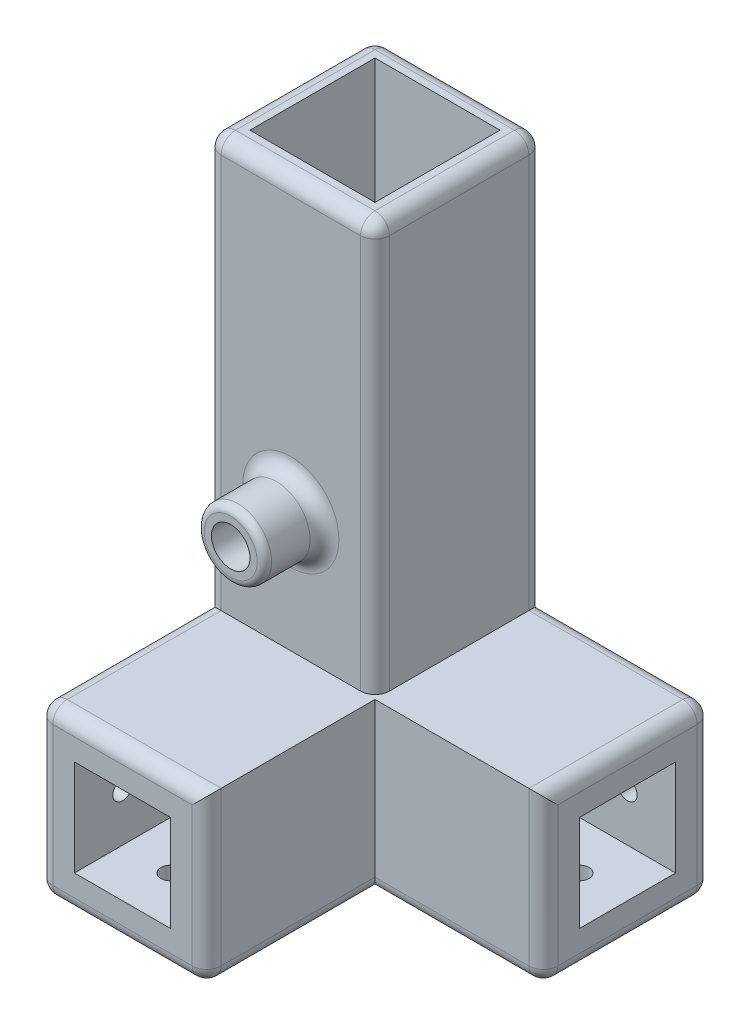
ISO-10303-21;
HEADER;
FILE_DESCRIPTION(('STEP AP214'),'2;1');
FILE_NAME('part.step','',(''),(''),'','','');
FILE_SCHEMA(('AUTOMOTIVE_DESIGN { 1 0 10303 214 1 1 1 1 }'));
ENDSEC;
DATA;
#1=APPLICATION_CONTEXT('core data for automotive mechanical design processes');
#2=APPLICATION_PROTOCOL_DEFINITION('international standard','automotive_design',2000,#1);
#3=PRODUCT_CONTEXT('',#1,'mechanical');
#4=PRODUCT('Part','Part','',(#3));
#5=PRODUCT_RELATED_PRODUCT_CATEGORY('part','',(#4));
#6=PRODUCT_DEFINITION_FORMATION('','',#4);
#7=PRODUCT_DEFINITION_CONTEXT('part definition',#1,'design');
#8=PRODUCT_DEFINITION('design','',#6,#7);
#9=PRODUCT_DEFINITION_SHAPE('','',#8);
#10=(LENGTH_UNIT() NAMED_UNIT(*) SI_UNIT(.MILLI.,.METRE.));
#11=(NAMED_UNIT(*) PLANE_ANGLE_UNIT() SI_UNIT($,.RADIAN.));
#12=(NAMED_UNIT(*) SI_UNIT($,.STERADIAN.) SOLID_ANGLE_UNIT());
#13=UNCERTAINTY_MEASURE_WITH_UNIT(LENGTH_MEASURE(1.E-05),#10,'distance_accuracy_value','');
#14=(GEOMETRIC_REPRESENTATION_CONTEXT(3) GLOBAL_UNCERTAINTY_ASSIGNED_CONTEXT((#13)) GLOBAL_UNIT_ASSIGNED_CONTEXT((#10,
#11,#12)) REPRESENTATION_CONTEXT('',''));
#15=CARTESIAN_POINT('',(0.,0.,0.));
#16=DIRECTION('',(0.,0.,1.));
#17=DIRECTION('',(1.,0.,0.));
#18=AXIS2_PLACEMENT_3D('',#15,#16,#17);
#19=CARTESIAN_POINT('',(0.,0.,35.));
#20=DIRECTION('',(0.,0.,1.));
#21=DIRECTION('',(1.,0.,0.));
#22=AXIS2_PLACEMENT_3D('',#19,#20,#21);
#23=PLANE('',#22);
#24=DIRECTION('',(0.,1.,0.));
#25=VECTOR('',#24,1.);
#26=CARTESIAN_POINT('',(35.,0.,35.));
#27=LINE('',#26,#25);
#28=CARTESIAN_POINT('',(35.,3.,35.));
#29=VERTEX_POINT('',#28);
#30=CARTESIAN_POINT('',(35.,35.,35.));
#31=VERTEX_POINT('',#30);
#32=EDGE_CURVE('E417',#29,#31,#27,.T.);
#33=ORIENTED_EDGE('',*,*,#32,.F.);
#34=DIRECTION('',(1.,0.,0.));
#35=VECTOR('',#34,1.);
#36=CARTESIAN_POINT('',(70.,3.,35.));
#37=LINE('',#36,#35);
#38=CARTESIAN_POINT('',(67.,3.,35.));
#39=VERTEX_POINT('',#38);
#40=EDGE_CURVE('E479',#29,#39,#37,.T.);
#41=ORIENTED_EDGE('',*,*,#40,.T.);
#42=DIRECTION('',(0.,1.,0.));
#43=VECTOR('',#42,1.);
#44=CARTESIAN_POINT('',(67.,35.,35.));
#45=LINE('',#44,#43);
#46=CARTESIAN_POINT('',(67.,35.,35.));
#47=VERTEX_POINT('',#46);
#48=EDGE_CURVE('E476',#39,#47,#45,.T.);
#49=ORIENTED_EDGE('',*,*,#48,.T.);
#50=DIRECTION('',(-1.,0.,0.));
#51=VECTOR('',#50,1.);
#52=CARTESIAN_POINT('',(70.,35.,35.));
#53=LINE('',#52,#51);
#54=EDGE_CURVE('E435',#47,#31,#53,.T.);
#55=ORIENTED_EDGE('',*,*,#54,.T.);
#56=EDGE_LOOP('',(#33,#41,#49,#55));
#57=FACE_BOUND('',#56,.T.);
#58=ADVANCED_FACE('F45',(#57),#23,.T.);
#59=CARTESIAN_POINT('',(0.,70.,35.));
#60=DIRECTION('',(1.,0.,0.));
#61=DIRECTION('',(0.,1.,0.));
#62=AXIS2_PLACEMENT_3D('',#59,#60,#61);
#63=PLANE('',#62);
#64=CARTESIAN_POINT('',(0.,100.,17.5));
#65=DIRECTION('',(-1.,0.,0.));
#66=DIRECTION('',(0.,-1.,0.));
#67=AXIS2_PLACEMENT_3D('',#64,#65,#66);
#68=CIRCLE('',#67,2.);
#69=CARTESIAN_POINT('',(0.,98.,17.5));
#70=VERTEX_POINT('',#69);
#71=EDGE_CURVE('E307',#70,#70,#68,.T.);
#72=ORIENTED_EDGE('',*,*,#71,.F.);
#73=EDGE_LOOP('',(#72));
#74=FACE_BOUND('',#73,.T.);
#75=CARTESIAN_POINT('',(0.,17.5,60.));
#76=DIRECTION('',(-1.,0.,0.));
#77=DIRECTION('',(0.,-1.,0.));
#78=AXIS2_PLACEMENT_3D('',#75,#76,#77);
#79=CIRCLE('',#78,2.);
#80=CARTESIAN_POINT('',(0.,15.5,60.));
#81=VERTEX_POINT('',#80);
#82=EDGE_CURVE('E336',#81,#81,#79,.T.);
#83=ORIENTED_EDGE('',*,*,#82,.F.);
#84=EDGE_LOOP('',(#83));
#85=FACE_BOUND('',#84,.T.);
#86=DIRECTION('',(0.,0.,1.));
#87=VECTOR('',#86,1.);
#88=CARTESIAN_POINT('',(0.,117.,0.));
#89=LINE('',#88,#87);
#90=CARTESIAN_POINT('',(0.,117.,32.));
#91=VERTEX_POINT('',#90);
#92=CARTESIAN_POINT('',(0.,117.,3.));
#93=VERTEX_POINT('',#92);
#94=EDGE_CURVE('E69',#91,#93,#89,.F.);
#95=ORIENTED_EDGE('',*,*,#94,.T.);
#96=DIRECTION('',(0.,-1.,0.));
#97=VECTOR('',#96,1.);
#98=CARTESIAN_POINT('',(0.,70.,3.));
#99=LINE('',#98,#97);
#100=CARTESIAN_POINT('',(0.,3.,3.));
#101=VERTEX_POINT('',#100);
#102=EDGE_CURVE('E672',#93,#101,#99,.T.);
#103=ORIENTED_EDGE('',*,*,#102,.T.);
#104=DIRECTION('',(0.,0.,-1.));
#105=VECTOR('',#104,1.);
#106=CARTESIAN_POINT('',(0.,3.,35.));
#107=LINE('',#106,#105);
#108=CARTESIAN_POINT('',(0.,3.,67.));
#109=VERTEX_POINT('',#108);
#110=EDGE_CURVE('E531',#101,#109,#107,.F.);
#111=ORIENTED_EDGE('',*,*,#110,.T.);
#112=DIRECTION('',(0.,-1.,0.));
#113=VECTOR('',#112,1.);
#114=CARTESIAN_POINT('',(0.,35.,67.));
#115=LINE('',#114,#113);
#116=CARTESIAN_POINT('',(0.,32.,67.));
#117=VERTEX_POINT('',#116);
#118=EDGE_CURVE('E528',#109,#117,#115,.F.);
#119=ORIENTED_EDGE('',*,*,#118,.T.);
#120=DIRECTION('',(0.,0.,-1.));
#121=VECTOR('',#120,1.);
#122=CARTESIAN_POINT('',(0.,32.,35.));
#123=LINE('',#122,#121);
#124=CARTESIAN_POINT('',(0.,32.,32.));
#125=VERTEX_POINT('',#124);
#126=EDGE_CURVE('E525',#117,#125,#123,.T.);
#127=ORIENTED_EDGE('',*,*,#126,.T.);
#128=DIRECTION('',(0.,-1.,0.));
#129=VECTOR('',#128,1.);
#130=CARTESIAN_POINT('',(0.,120.,32.));
#131=LINE('',#130,#129);
#132=EDGE_CURVE('E667',#125,#91,#131,.F.);
#133=ORIENTED_EDGE('',*,*,#132,.T.);
#134=EDGE_LOOP('',(#95,#103,#111,#119,#127,#133));
#135=FACE_BOUND('',#134,.T.);
#136=ADVANCED_FACE('F778',(#74,#85,#135),#63,.F.);
#137=CARTESIAN_POINT('',(0.,0.,35.));
#138=DIRECTION('',(0.,1.,0.));
#139=DIRECTION('',(0.,0.,1.));
#140=AXIS2_PLACEMENT_3D('',#137,#138,#139);
#141=PLANE('',#140);
#142=CARTESIAN_POINT('',(17.5,0.,60.));
#143=DIRECTION('',(0.,-1.,0.));
#144=DIRECTION('',(0.,0.,-1.));
#145=AXIS2_PLACEMENT_3D('',#142,#143,#144);
#146=CIRCLE('',#145,2.);
#147=CARTESIAN_POINT('',(17.5,0.,58.));
#148=VERTEX_POINT('',#147);
#149=EDGE_CURVE('E750',#148,#148,#146,.T.);
#150=ORIENTED_EDGE('',*,*,#149,.F.);
#151=EDGE_LOOP('',(#150));
#152=FACE_BOUND('',#151,.T.);
#153=CARTESIAN_POINT('',(60.,0.,17.5));
#154=DIRECTION('',(0.,-1.,0.));
#155=DIRECTION('',(0.,0.,-1.));
#156=AXIS2_PLACEMENT_3D('',#153,#154,#155);
#157=CIRCLE('',#156,2.);
#158=CARTESIAN_POINT('',(60.,0.,15.5));
#159=VERTEX_POINT('',#158);
#160=EDGE_CURVE('E1275',#159,#159,#157,.T.);
#161=ORIENTED_EDGE('',*,*,#160,.F.);
#162=EDGE_LOOP('',(#161));
#163=FACE_BOUND('',#162,.T.);
#164=DIRECTION('',(1.,0.,0.));
#165=VECTOR('',#164,1.);
#166=CARTESIAN_POINT('',(0.,0.,3.));
#167=LINE('',#166,#165);
#168=CARTESIAN_POINT('',(3.,0.,3.));
#169=VERTEX_POINT('',#168);
#170=CARTESIAN_POINT('',(67.,0.,3.));
#171=VERTEX_POINT('',#170);
#172=EDGE_CURVE('E460',#169,#171,#167,.T.);
#173=ORIENTED_EDGE('',*,*,#172,.T.);
#174=DIRECTION('',(0.,0.,-1.));
#175=VECTOR('',#174,1.);
#176=CARTESIAN_POINT('',(67.,0.,35.));
#177=LINE('',#176,#175);
#178=CARTESIAN_POINT('',(67.,0.,32.));
#179=VERTEX_POINT('',#178);
#180=EDGE_CURVE('E472',#171,#179,#177,.F.);
#181=ORIENTED_EDGE('',*,*,#180,.T.);
#182=DIRECTION('',(1.,0.,0.));
#183=VECTOR('',#182,1.);
#184=CARTESIAN_POINT('',(35.,0.,32.));
#185=LINE('',#184,#183);
#186=CARTESIAN_POINT('',(32.,0.,32.));
#187=VERTEX_POINT('',#186);
#188=EDGE_CURVE('E469',#179,#187,#185,.F.);
#189=ORIENTED_EDGE('',*,*,#188,.T.);
#190=DIRECTION('',(0.,0.,-1.));
#191=VECTOR('',#190,1.);
#192=CARTESIAN_POINT('',(32.,0.,35.));
#193=LINE('',#192,#191);
#194=CARTESIAN_POINT('',(32.,0.,67.));
#195=VERTEX_POINT('',#194);
#196=EDGE_CURVE('E466',#187,#195,#193,.F.);
#197=ORIENTED_EDGE('',*,*,#196,.T.);
#198=DIRECTION('',(1.,0.,0.));
#199=VECTOR('',#198,1.);
#200=CARTESIAN_POINT('',(0.,0.,67.));
#201=LINE('',#200,#199);
#202=CARTESIAN_POINT('',(3.,0.,67.));
#203=VERTEX_POINT('',#202);
#204=EDGE_CURVE('E463',#195,#203,#201,.F.);
#205=ORIENTED_EDGE('',*,*,#204,.T.);
#206=DIRECTION('',(0.,0.,-1.));
#207=VECTOR('',#206,1.);
#208=CARTESIAN_POINT('',(3.,0.,35.));
#209=LINE('',#208,#207);
#210=EDGE_CURVE('E456',#203,#169,#209,.T.);
#211=ORIENTED_EDGE('',*,*,#210,.T.);
#212=EDGE_LOOP('',(#173,#181,#189,#197,#205,#211));
#213=FACE_BOUND('',#212,.T.);
#214=ADVANCED_FACE('F785',(#152,#163,#213),#141,.F.);
#215=CARTESIAN_POINT('',(70.,0.,35.));
#216=DIRECTION('',(-1.,0.,0.));
#217=DIRECTION('',(0.,0.,1.));
#218=AXIS2_PLACEMENT_3D('',#215,#216,#217);
#219=PLANE('',#218);
#220=DIRECTION('',(0.,1.,0.));
#221=VECTOR('',#220,1.);
#222=CARTESIAN_POINT('',(70.,0.,32.));
#223=LINE('',#222,#221);
#224=CARTESIAN_POINT('',(70.,32.,32.));
#225=VERTEX_POINT('',#224);
#226=CARTESIAN_POINT('',(70.,3.,32.));
#227=VERTEX_POINT('',#226);
#228=EDGE_CURVE('E449',#225,#227,#223,.F.);
#229=ORIENTED_EDGE('',*,*,#228,.T.);
#230=DIRECTION('',(0.,0.,-1.));
#231=VECTOR('',#230,1.);
#232=CARTESIAN_POINT('',(70.,3.,35.));
#233=LINE('',#232,#231);
#234=CARTESIAN_POINT('',(70.,3.,3.));
#235=VERTEX_POINT('',#234);
#236=EDGE_CURVE('E452',#227,#235,#233,.T.);
#237=ORIENTED_EDGE('',*,*,#236,.T.);
#238=DIRECTION('',(0.,1.,0.));
#239=VECTOR('',#238,1.);
#240=CARTESIAN_POINT('',(70.,0.,3.));
#241=LINE('',#240,#239);
#242=CARTESIAN_POINT('',(70.,32.,3.));
#243=VERTEX_POINT('',#242);
#244=EDGE_CURVE('E443',#235,#243,#241,.T.);
#245=ORIENTED_EDGE('',*,*,#244,.T.);
#246=DIRECTION('',(0.,0.,-1.));
#247=VECTOR('',#246,1.);
#248=CARTESIAN_POINT('',(70.,32.,35.));
#249=LINE('',#248,#247);
#250=EDGE_CURVE('E446',#243,#225,#249,.F.);
#251=ORIENTED_EDGE('',*,*,#250,.T.);
#252=EDGE_LOOP('',(#229,#237,#245,#251));
#253=FACE_BOUND('',#252,.T.);
#254=DIRECTION('',(0.,0.,-1.));
#255=VECTOR('',#254,1.);
#256=CARTESIAN_POINT('',(70.,7.5,27.5));
#257=LINE('',#256,#255);
#258=CARTESIAN_POINT('',(70.,7.5,27.5));
#259=VERTEX_POINT('',#258);
#260=CARTESIAN_POINT('',(70.,7.5,7.5));
#261=VERTEX_POINT('',#260);
#262=EDGE_CURVE('E360',#259,#261,#257,.T.);
#263=ORIENTED_EDGE('',*,*,#262,.F.);
#264=DIRECTION('',(0.,-1.,0.));
#265=VECTOR('',#264,1.);
#266=CARTESIAN_POINT('',(70.,27.5,27.5));
#267=LINE('',#266,#265);
#268=CARTESIAN_POINT('',(70.,27.5,27.5));
#269=VERTEX_POINT('',#268);
#270=EDGE_CURVE('E357',#269,#259,#267,.T.);
#271=ORIENTED_EDGE('',*,*,#270,.F.);
#272=DIRECTION('',(0.,0.,-1.));
#273=VECTOR('',#272,1.);
#274=CARTESIAN_POINT('',(70.,27.5,27.5));
#275=LINE('',#274,#273);
#276=CARTESIAN_POINT('',(70.,27.5,7.50000000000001));
#277=VERTEX_POINT('',#276);
#278=EDGE_CURVE('E346',#269,#277,#275,.T.);
#279=ORIENTED_EDGE('',*,*,#278,.T.);
#280=DIRECTION('',(0.,-1.,0.));
#281=VECTOR('',#280,1.);
#282=CARTESIAN_POINT('',(70.,27.5,7.50000000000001));
#283=LINE('',#282,#281);
#284=EDGE_CURVE('E365',#277,#261,#283,.T.);
#285=ORIENTED_EDGE('',*,*,#284,.T.);
#286=EDGE_LOOP('',(#263,#271,#279,#285));
#287=FACE_BOUND('',#286,.T.);
#288=ADVANCED_FACE('F954',(#253,#287),#219,.F.);
#289=CARTESIAN_POINT('',(70.,35.,35.));
#290=DIRECTION('',(0.,-1.,0.));
#291=DIRECTION('',(0.,0.,-1.));
#292=AXIS2_PLACEMENT_3D('',#289,#290,#291);
#293=PLANE('',#292);
#294=ORIENTED_EDGE('',*,*,#54,.F.);
#295=DIRECTION('',(0.,0.,-1.));
#296=VECTOR('',#295,1.);
#297=CARTESIAN_POINT('',(67.,35.,35.));
#298=LINE('',#297,#296);
#299=CARTESIAN_POINT('',(67.,35.,3.));
#300=VERTEX_POINT('',#299);
#301=EDGE_CURVE('E506',#47,#300,#298,.T.);
#302=ORIENTED_EDGE('',*,*,#301,.T.);
#303=DIRECTION('',(-1.,0.,0.));
#304=VECTOR('',#303,1.);
#305=CARTESIAN_POINT('',(70.,35.,3.));
#306=LINE('',#305,#304);
#307=CARTESIAN_POINT('',(35.,35.,3.));
#308=VERTEX_POINT('',#307);
#309=EDGE_CURVE('E502',#300,#308,#306,.T.);
#310=ORIENTED_EDGE('',*,*,#309,.T.);
#311=DIRECTION('',(0.,0.,-1.));
#312=VECTOR('',#311,1.);
#313=CARTESIAN_POINT('',(35.,35.,35.));
#314=LINE('',#313,#312);
#315=CARTESIAN_POINT('',(35.,35.,32.));
#316=VERTEX_POINT('',#315);
#317=EDGE_CURVE('E439',#316,#308,#314,.T.);
#318=ORIENTED_EDGE('',*,*,#317,.F.);
#319=CARTESIAN_POINT('',(32.,35.,32.));
#320=DIRECTION('',(0.,-1.,0.));
#321=DIRECTION('',(0.,0.,-1.));
#322=AXIS2_PLACEMENT_3D('',#319,#320,#321);
#323=CIRCLE('',#322,3.);
#324=CARTESIAN_POINT('',(32.,35.,35.));
#325=VERTEX_POINT('',#324);
#326=EDGE_CURVE('E675',#316,#325,#323,.T.);
#327=ORIENTED_EDGE('',*,*,#326,.T.);
#328=DIRECTION('',(-1.,0.,0.));
#329=VECTOR('',#328,1.);
#330=CARTESIAN_POINT('',(35.,35.,35.));
#331=LINE('',#330,#329);
#332=CARTESIAN_POINT('',(3.,35.,35.));
#333=VERTEX_POINT('',#332);
#334=EDGE_CURVE('E61',#325,#333,#331,.T.);
#335=ORIENTED_EDGE('',*,*,#334,.T.);
#336=DIRECTION('',(0.,0.,-1.));
#337=VECTOR('',#336,1.);
#338=CARTESIAN_POINT('',(3.,35.,70.));
#339=LINE('',#338,#337);
#340=CARTESIAN_POINT('',(3.,35.,67.));
#341=VERTEX_POINT('',#340);
#342=EDGE_CURVE('E519',#333,#341,#339,.F.);
#343=ORIENTED_EDGE('',*,*,#342,.T.);
#344=DIRECTION('',(-1.,0.,0.));
#345=VECTOR('',#344,1.);
#346=CARTESIAN_POINT('',(35.,35.,67.));
#347=LINE('',#346,#345);
#348=CARTESIAN_POINT('',(35.,35.,67.));
#349=VERTEX_POINT('',#348);
#350=EDGE_CURVE('E522',#341,#349,#347,.F.);
#351=ORIENTED_EDGE('',*,*,#350,.T.);
#352=DIRECTION('',(0.,0.,-1.));
#353=VECTOR('',#352,1.);
#354=CARTESIAN_POINT('',(35.,35.,70.));
#355=LINE('',#354,#353);
#356=EDGE_CURVE('E432',#349,#31,#355,.T.);
#357=ORIENTED_EDGE('',*,*,#356,.T.);
#358=EDGE_LOOP('',(#294,#302,#310,#318,#327,#335,#343,#351,#357));
#359=FACE_BOUND('',#358,.T.);
#360=ADVANCED_FACE('F803',(#359),#293,.F.);
#361=CARTESIAN_POINT('',(35.,35.,35.));
#362=DIRECTION('',(-1.,0.,0.));
#363=DIRECTION('',(0.,0.,1.));
#364=AXIS2_PLACEMENT_3D('',#361,#362,#363);
#365=PLANE('',#364);
#366=DIRECTION('',(0.,0.,-1.));
#367=VECTOR('',#366,1.);
#368=CARTESIAN_POINT('',(35.,117.,35.));
#369=LINE('',#368,#367);
#370=CARTESIAN_POINT('',(35.,117.,3.));
#371=VERTEX_POINT('',#370);
#372=CARTESIAN_POINT('',(35.,117.,32.));
#373=VERTEX_POINT('',#372);
#374=EDGE_CURVE('E642',#371,#373,#369,.F.);
#375=ORIENTED_EDGE('',*,*,#374,.T.);
#376=DIRECTION('',(0.,1.,0.));
#377=VECTOR('',#376,1.);
#378=CARTESIAN_POINT('',(35.,35.,32.));
#379=LINE('',#378,#377);
#380=EDGE_CURVE('E645',#373,#316,#379,.F.);
#381=ORIENTED_EDGE('',*,*,#380,.T.);
#382=ORIENTED_EDGE('',*,*,#317,.T.);
#383=DIRECTION('',(0.,1.,0.));
#384=VECTOR('',#383,1.);
#385=CARTESIAN_POINT('',(35.,35.,3.));
#386=LINE('',#385,#384);
#387=EDGE_CURVE('E639',#308,#371,#386,.T.);
#388=ORIENTED_EDGE('',*,*,#387,.T.);
#389=EDGE_LOOP('',(#375,#381,#382,#388));
#390=FACE_BOUND('',#389,.T.);
#391=ADVANCED_FACE('F793',(#390),#365,.F.);
#392=CARTESIAN_POINT('',(17.5,60.,35.));
#393=DIRECTION('',(0.,0.,1.));
#394=DIRECTION('',(1.,0.,0.));
#395=AXIS2_PLACEMENT_3D('',#392,#393,#394);
#396=CIRCLE('',#395,10.);
#397=CARTESIAN_POINT('',(27.5,60.,35.));
#398=VERTEX_POINT('',#397);
#399=EDGE_CURVE('E757',#398,#398,#396,.F.);
#400=ORIENTED_EDGE('',*,*,#399,.T.);
#401=EDGE_LOOP('',(#400));
#402=FACE_BOUND('',#401,.T.);
#403=ORIENTED_EDGE('',*,*,#334,.F.);
#404=DIRECTION('',(0.,1.,0.));
#405=VECTOR('',#404,1.);
#406=CARTESIAN_POINT('',(32.,120.,35.));
#407=LINE('',#406,#405);
#408=CARTESIAN_POINT('',(32.,117.,35.));
#409=VERTEX_POINT('',#408);
#410=EDGE_CURVE('E654',#325,#409,#407,.T.);
#411=ORIENTED_EDGE('',*,*,#410,.T.);
#412=DIRECTION('',(1.,0.,0.));
#413=VECTOR('',#412,1.);
#414=CARTESIAN_POINT('',(0.,117.,35.));
#415=LINE('',#414,#413);
#416=CARTESIAN_POINT('',(3.,117.,35.));
#417=VERTEX_POINT('',#416);
#418=EDGE_CURVE('E651',#409,#417,#415,.F.);
#419=ORIENTED_EDGE('',*,*,#418,.T.);
#420=DIRECTION('',(0.,-1.,0.));
#421=VECTOR('',#420,1.);
#422=CARTESIAN_POINT('',(3.,32.,35.));
#423=LINE('',#422,#421);
#424=EDGE_CURVE('E648',#417,#333,#423,.T.);
#425=ORIENTED_EDGE('',*,*,#424,.T.);
#426=EDGE_LOOP('',(#403,#411,#419,#425));
#427=FACE_BOUND('',#426,.T.);
#428=ADVANCED_FACE('F781',(#402,#427),#23,.T.);
#429=CARTESIAN_POINT('',(0.,0.,0.));
#430=DIRECTION('',(0.,0.,1.));
#431=DIRECTION('',(1.,0.,0.));
#432=AXIS2_PLACEMENT_3D('',#429,#430,#431);
#433=PLANE('',#432);
#434=CARTESIAN_POINT('',(17.5,100.,0.));
#435=DIRECTION('',(0.,0.,-1.));
#436=DIRECTION('',(-1.,0.,0.));
#437=AXIS2_PLACEMENT_3D('',#434,#435,#436);
#438=CIRCLE('',#437,2.);
#439=CARTESIAN_POINT('',(15.5,100.,0.));
#440=VERTEX_POINT('',#439);
#441=EDGE_CURVE('E744',#440,#440,#438,.T.);
#442=ORIENTED_EDGE('',*,*,#441,.F.);
#443=EDGE_LOOP('',(#442));
#444=FACE_BOUND('',#443,.T.);
#445=CARTESIAN_POINT('',(60.,17.5,0.));
#446=DIRECTION('',(0.,0.,-1.));
#447=DIRECTION('',(-1.,0.,0.));
#448=AXIS2_PLACEMENT_3D('',#445,#446,#447);
#449=CIRCLE('',#448,2.);
#450=CARTESIAN_POINT('',(58.,17.5,0.));
#451=VERTEX_POINT('',#450);
#452=EDGE_CURVE('E326',#451,#451,#449,.T.);
#453=ORIENTED_EDGE('',*,*,#452,.F.);
#454=EDGE_LOOP('',(#453));
#455=FACE_BOUND('',#454,.T.);
#456=DIRECTION('',(0.,1.,0.));
#457=VECTOR('',#456,1.);
#458=CARTESIAN_POINT('',(32.,0.,0.));
#459=LINE('',#458,#457);
#460=CARTESIAN_POINT('',(32.,117.,0.));
#461=VERTEX_POINT('',#460);
#462=CARTESIAN_POINT('',(32.,32.,0.));
#463=VERTEX_POINT('',#462);
#464=EDGE_CURVE('E663',#461,#463,#459,.F.);
#465=ORIENTED_EDGE('',*,*,#464,.T.);
#466=DIRECTION('',(-1.,0.,0.));
#467=VECTOR('',#466,1.);
#468=CARTESIAN_POINT('',(0.,32.,0.));
#469=LINE('',#468,#467);
#470=CARTESIAN_POINT('',(67.,32.,0.));
#471=VERTEX_POINT('',#470);
#472=EDGE_CURVE('E509',#463,#471,#469,.F.);
#473=ORIENTED_EDGE('',*,*,#472,.T.);
#474=DIRECTION('',(0.,1.,0.));
#475=VECTOR('',#474,1.);
#476=CARTESIAN_POINT('',(67.,0.,0.));
#477=LINE('',#476,#475);
#478=CARTESIAN_POINT('',(67.,3.,0.));
#479=VERTEX_POINT('',#478);
#480=EDGE_CURVE('E512',#471,#479,#477,.F.);
#481=ORIENTED_EDGE('',*,*,#480,.T.);
#482=DIRECTION('',(1.,0.,0.));
#483=VECTOR('',#482,1.);
#484=CARTESIAN_POINT('',(0.,3.,0.));
#485=LINE('',#484,#483);
#486=CARTESIAN_POINT('',(3.,3.,0.));
#487=VERTEX_POINT('',#486);
#488=EDGE_CURVE('E515',#479,#487,#485,.F.);
#489=ORIENTED_EDGE('',*,*,#488,.T.);
#490=DIRECTION('',(0.,-1.,0.));
#491=VECTOR('',#490,1.);
#492=CARTESIAN_POINT('',(3.,0.,0.));
#493=LINE('',#492,#491);
#494=CARTESIAN_POINT('',(3.,117.,0.));
#495=VERTEX_POINT('',#494);
#496=EDGE_CURVE('E657',#487,#495,#493,.F.);
#497=ORIENTED_EDGE('',*,*,#496,.T.);
#498=DIRECTION('',(-1.,0.,0.));
#499=VECTOR('',#498,1.);
#500=CARTESIAN_POINT('',(35.,117.,0.));
#501=LINE('',#500,#499);
#502=EDGE_CURVE('E660',#495,#461,#501,.F.);
#503=ORIENTED_EDGE('',*,*,#502,.T.);
#504=EDGE_LOOP('',(#465,#473,#481,#489,#497,#503));
#505=FACE_BOUND('',#504,.T.);
#506=ADVANCED_FACE('F792',(#444,#455,#505),#433,.F.);
#507=CARTESIAN_POINT('',(35.,0.,70.));
#508=DIRECTION('',(-1.,0.,0.));
#509=DIRECTION('',(0.,0.,1.));
#510=AXIS2_PLACEMENT_3D('',#507,#508,#509);
#511=PLANE('',#510);
#512=DIRECTION('',(0.,1.,0.));
#513=VECTOR('',#512,1.);
#514=CARTESIAN_POINT('',(35.,0.,67.));
#515=LINE('',#514,#513);
#516=CARTESIAN_POINT('',(35.,3.,67.));
#517=VERTEX_POINT('',#516);
#518=EDGE_CURVE('E483',#349,#517,#515,.F.);
#519=ORIENTED_EDGE('',*,*,#518,.T.);
#520=DIRECTION('',(0.,0.,-1.));
#521=VECTOR('',#520,1.);
#522=CARTESIAN_POINT('',(35.,3.,70.));
#523=LINE('',#522,#521);
#524=EDGE_CURVE('E486',#517,#29,#523,.T.);
#525=ORIENTED_EDGE('',*,*,#524,.T.);
#526=ORIENTED_EDGE('',*,*,#32,.T.);
#527=ORIENTED_EDGE('',*,*,#356,.F.);
#528=EDGE_LOOP('',(#519,#525,#526,#527));
#529=FACE_BOUND('',#528,.T.);
#530=ADVANCED_FACE('F800',(#529),#511,.F.);
#531=CARTESIAN_POINT('',(0.,0.,70.));
#532=DIRECTION('',(0.,0.,1.));
#533=DIRECTION('',(1.,0.,0.));
#534=AXIS2_PLACEMENT_3D('',#531,#532,#533);
#535=PLANE('',#534);
#536=DIRECTION('',(0.,-1.,0.));
#537=VECTOR('',#536,1.);
#538=CARTESIAN_POINT('',(3.,0.,70.));
#539=LINE('',#538,#537);
#540=CARTESIAN_POINT('',(3.,32.,70.));
#541=VERTEX_POINT('',#540);
#542=CARTESIAN_POINT('',(3.,3.,70.));
#543=VERTEX_POINT('',#542);
#544=EDGE_CURVE('E489',#541,#543,#539,.T.);
#545=ORIENTED_EDGE('',*,*,#544,.T.);
#546=DIRECTION('',(1.,0.,0.));
#547=VECTOR('',#546,1.);
#548=CARTESIAN_POINT('',(35.,3.,70.));
#549=LINE('',#548,#547);
#550=CARTESIAN_POINT('',(32.,3.,70.));
#551=VERTEX_POINT('',#550);
#552=EDGE_CURVE('E498',#543,#551,#549,.T.);
#553=ORIENTED_EDGE('',*,*,#552,.T.);
#554=DIRECTION('',(0.,1.,0.));
#555=VECTOR('',#554,1.);
#556=CARTESIAN_POINT('',(32.,35.,70.));
#557=LINE('',#556,#555);
#558=CARTESIAN_POINT('',(32.,32.,70.));
#559=VERTEX_POINT('',#558);
#560=EDGE_CURVE('E495',#551,#559,#557,.T.);
#561=ORIENTED_EDGE('',*,*,#560,.T.);
#562=DIRECTION('',(-1.,0.,0.));
#563=VECTOR('',#562,1.);
#564=CARTESIAN_POINT('',(0.,32.,70.));
#565=LINE('',#564,#563);
#566=EDGE_CURVE('E492',#559,#541,#565,.T.);
#567=ORIENTED_EDGE('',*,*,#566,.T.);
#568=EDGE_LOOP('',(#545,#553,#561,#567));
#569=FACE_BOUND('',#568,.T.);
#570=DIRECTION('',(0.,-1.,0.));
#571=VECTOR('',#570,1.);
#572=CARTESIAN_POINT('',(7.5,27.5,70.));
#573=LINE('',#572,#571);
#574=CARTESIAN_POINT('',(7.5,27.5,70.));
#575=VERTEX_POINT('',#574);
#576=CARTESIAN_POINT('',(7.5,7.5,70.));
#577=VERTEX_POINT('',#576);
#578=EDGE_CURVE('E375',#575,#577,#573,.T.);
#579=ORIENTED_EDGE('',*,*,#578,.F.);
#580=DIRECTION('',(1.,0.,0.));
#581=VECTOR('',#580,1.);
#582=CARTESIAN_POINT('',(7.5,27.5,70.));
#583=LINE('',#582,#581);
#584=CARTESIAN_POINT('',(27.5,27.5,70.));
#585=VERTEX_POINT('',#584);
#586=EDGE_CURVE('E390',#575,#585,#583,.T.);
#587=ORIENTED_EDGE('',*,*,#586,.T.);
#588=DIRECTION('',(0.,-1.,0.));
#589=VECTOR('',#588,1.);
#590=CARTESIAN_POINT('',(27.5,27.5,70.));
#591=LINE('',#590,#589);
#592=CARTESIAN_POINT('',(27.5,7.5,70.));
#593=VERTEX_POINT('',#592);
#594=EDGE_CURVE('E407',#585,#593,#591,.T.);
#595=ORIENTED_EDGE('',*,*,#594,.T.);
#596=DIRECTION('',(1.,0.,0.));
#597=VECTOR('',#596,1.);
#598=CARTESIAN_POINT('',(7.5,7.5,70.));
#599=LINE('',#598,#597);
#600=EDGE_CURVE('E403',#577,#593,#599,.T.);
#601=ORIENTED_EDGE('',*,*,#600,.F.);
#602=EDGE_LOOP('',(#579,#587,#595,#601));
#603=FACE_BOUND('',#602,.T.);
#604=ADVANCED_FACE('F909',(#569,#603),#535,.T.);
#605=CARTESIAN_POINT('',(7.5,27.5,50.));
#606=DIRECTION('',(-1.,0.,0.));
#607=DIRECTION('',(0.,-1.,0.));
#608=AXIS2_PLACEMENT_3D('',#605,#606,#607);
#609=PLANE('',#608);
#610=CARTESIAN_POINT('',(7.5,17.5,60.));
#611=DIRECTION('',(-1.,0.,0.));
#612=DIRECTION('',(0.,-1.,0.));
#613=AXIS2_PLACEMENT_3D('',#610,#611,#612);
#614=CIRCLE('',#613,2.);
#615=CARTESIAN_POINT('',(7.5,15.5,60.));
#616=VERTEX_POINT('',#615);
#617=EDGE_CURVE('E340',#616,#616,#614,.T.);
#618=ORIENTED_EDGE('',*,*,#617,.T.);
#619=EDGE_LOOP('',(#618));
#620=FACE_BOUND('',#619,.T.);
#621=ORIENTED_EDGE('',*,*,#578,.T.);
#622=DIRECTION('',(0.,0.,1.));
#623=VECTOR('',#622,1.);
#624=CARTESIAN_POINT('',(7.5,7.5,50.));
#625=LINE('',#624,#623);
#626=CARTESIAN_POINT('',(7.5,7.5,50.));
#627=VERTEX_POINT('',#626);
#628=EDGE_CURVE('E400',#627,#577,#625,.T.);
#629=ORIENTED_EDGE('',*,*,#628,.F.);
#630=DIRECTION('',(0.,-1.,0.));
#631=VECTOR('',#630,1.);
#632=CARTESIAN_POINT('',(7.5,27.5,50.));
#633=LINE('',#632,#631);
#634=CARTESIAN_POINT('',(7.5,27.5,50.));
#635=VERTEX_POINT('',#634);
#636=EDGE_CURVE('E385',#635,#627,#633,.T.);
#637=ORIENTED_EDGE('',*,*,#636,.F.);
#638=DIRECTION('',(0.,0.,1.));
#639=VECTOR('',#638,1.);
#640=CARTESIAN_POINT('',(7.5,27.5,50.));
#641=LINE('',#640,#639);
#642=EDGE_CURVE('E414',#635,#575,#641,.T.);
#643=ORIENTED_EDGE('',*,*,#642,.T.);
#644=EDGE_LOOP('',(#621,#629,#637,#643));
#645=FACE_BOUND('',#644,.T.);
#646=ADVANCED_FACE('F899',(#620,#645),#609,.F.);
#647=CARTESIAN_POINT('',(7.5,27.5,50.));
#648=DIRECTION('',(0.,-1.,0.));
#649=DIRECTION('',(0.,0.,-1.));
#650=AXIS2_PLACEMENT_3D('',#647,#648,#649);
#651=PLANE('',#650);
#652=ORIENTED_EDGE('',*,*,#586,.F.);
#653=ORIENTED_EDGE('',*,*,#642,.F.);
#654=DIRECTION('',(1.,0.,0.));
#655=VECTOR('',#654,1.);
#656=CARTESIAN_POINT('',(7.5,27.5,50.));
#657=LINE('',#656,#655);
#658=CARTESIAN_POINT('',(27.5,27.5,50.));
#659=VERTEX_POINT('',#658);
#660=EDGE_CURVE('E397',#635,#659,#657,.T.);
#661=ORIENTED_EDGE('',*,*,#660,.T.);
#662=DIRECTION('',(0.,0.,1.));
#663=VECTOR('',#662,1.);
#664=CARTESIAN_POINT('',(27.5,27.5,50.));
#665=LINE('',#664,#663);
#666=EDGE_CURVE('E418',#659,#585,#665,.T.);
#667=ORIENTED_EDGE('',*,*,#666,.T.);
#668=EDGE_LOOP('',(#652,#653,#661,#667));
#669=FACE_BOUND('',#668,.T.);
#670=ADVANCED_FACE('F895',(#669),#651,.T.);
#671=CARTESIAN_POINT('',(27.5,27.5,50.));
#672=DIRECTION('',(-1.,0.,0.));
#673=DIRECTION('',(0.,-1.,0.));
#674=AXIS2_PLACEMENT_3D('',#671,#672,#673);
#675=PLANE('',#674);
#676=ORIENTED_EDGE('',*,*,#594,.F.);
#677=ORIENTED_EDGE('',*,*,#666,.F.);
#678=DIRECTION('',(0.,-1.,0.));
#679=VECTOR('',#678,1.);
#680=CARTESIAN_POINT('',(27.5,27.5,50.));
#681=LINE('',#680,#679);
#682=CARTESIAN_POINT('',(27.5,7.5,50.));
#683=VERTEX_POINT('',#682);
#684=EDGE_CURVE('E394',#659,#683,#681,.T.);
#685=ORIENTED_EDGE('',*,*,#684,.T.);
#686=DIRECTION('',(0.,0.,1.));
#687=VECTOR('',#686,1.);
#688=CARTESIAN_POINT('',(27.5,7.5,50.));
#689=LINE('',#688,#687);
#690=EDGE_CURVE('E421',#683,#593,#689,.T.);
#691=ORIENTED_EDGE('',*,*,#690,.T.);
#692=EDGE_LOOP('',(#676,#677,#685,#691));
#693=FACE_BOUND('',#692,.T.);
#694=ADVANCED_FACE('F898',(#693),#675,.T.);
#695=CARTESIAN_POINT('',(7.5,7.5,50.));
#696=DIRECTION('',(0.,-1.,0.));
#697=DIRECTION('',(0.,0.,-1.));
#698=AXIS2_PLACEMENT_3D('',#695,#696,#697);
#699=PLANE('',#698);
#700=CARTESIAN_POINT('',(17.5,7.5,60.));
#701=DIRECTION('',(0.,-1.,0.));
#702=DIRECTION('',(0.,0.,-1.));
#703=AXIS2_PLACEMENT_3D('',#700,#701,#702);
#704=CIRCLE('',#703,2.);
#705=CARTESIAN_POINT('',(17.5,7.5,58.));
#706=VERTEX_POINT('',#705);
#707=EDGE_CURVE('E749',#706,#706,#704,.T.);
#708=ORIENTED_EDGE('',*,*,#707,.T.);
#709=EDGE_LOOP('',(#708));
#710=FACE_BOUND('',#709,.T.);
#711=ORIENTED_EDGE('',*,*,#600,.T.);
#712=ORIENTED_EDGE('',*,*,#690,.F.);
#713=DIRECTION('',(1.,0.,0.));
#714=VECTOR('',#713,1.);
#715=CARTESIAN_POINT('',(7.5,7.5,50.));
#716=LINE('',#715,#714);
#717=EDGE_CURVE('E389',#627,#683,#716,.T.);
#718=ORIENTED_EDGE('',*,*,#717,.F.);
#719=ORIENTED_EDGE('',*,*,#628,.T.);
#720=EDGE_LOOP('',(#711,#712,#718,#719));
#721=FACE_BOUND('',#720,.T.);
#722=ADVANCED_FACE('F893',(#710,#721),#699,.F.);
#723=CARTESIAN_POINT('',(0.,0.,50.));
#724=DIRECTION('',(0.,0.,1.));
#725=DIRECTION('',(1.,0.,0.));
#726=AXIS2_PLACEMENT_3D('',#723,#724,#725);
#727=PLANE('',#726);
#728=ORIENTED_EDGE('',*,*,#636,.T.);
#729=ORIENTED_EDGE('',*,*,#717,.T.);
#730=ORIENTED_EDGE('',*,*,#684,.F.);
#731=ORIENTED_EDGE('',*,*,#660,.F.);
#732=EDGE_LOOP('',(#728,#729,#730,#731));
#733=FACE_BOUND('',#732,.T.);
#734=ADVANCED_FACE('F889',(#733),#727,.T.);
#735=CARTESIAN_POINT('',(50.,27.5,27.5));
#736=DIRECTION('',(0.,0.,1.));
#737=DIRECTION('',(0.,-1.,0.));
#738=AXIS2_PLACEMENT_3D('',#735,#736,#737);
#739=PLANE('',#738);
#740=ORIENTED_EDGE('',*,*,#270,.T.);
#741=DIRECTION('',(1.,0.,0.));
#742=VECTOR('',#741,1.);
#743=CARTESIAN_POINT('',(50.,7.5,27.5));
#744=LINE('',#743,#742);
#745=CARTESIAN_POINT('',(50.,7.5,27.5));
#746=VERTEX_POINT('',#745);
#747=EDGE_CURVE('E356',#746,#259,#744,.T.);
#748=ORIENTED_EDGE('',*,*,#747,.F.);
#749=DIRECTION('',(0.,-1.,0.));
#750=VECTOR('',#749,1.);
#751=CARTESIAN_POINT('',(50.,27.5,27.5));
#752=LINE('',#751,#750);
#753=CARTESIAN_POINT('',(50.,27.5,27.5));
#754=VERTEX_POINT('',#753);
#755=EDGE_CURVE('E341',#754,#746,#752,.T.);
#756=ORIENTED_EDGE('',*,*,#755,.F.);
#757=DIRECTION('',(1.,0.,0.));
#758=VECTOR('',#757,1.);
#759=CARTESIAN_POINT('',(50.,27.5,27.5));
#760=LINE('',#759,#758);
#761=EDGE_CURVE('E372',#754,#269,#760,.T.);
#762=ORIENTED_EDGE('',*,*,#761,.T.);
#763=EDGE_LOOP('',(#740,#748,#756,#762));
#764=FACE_BOUND('',#763,.T.);
#765=ADVANCED_FACE('F879',(#764),#739,.F.);
#766=CARTESIAN_POINT('',(50.,27.5,27.5));
#767=DIRECTION('',(0.,-1.,0.));
#768=DIRECTION('',(0.,0.,-1.));
#769=AXIS2_PLACEMENT_3D('',#766,#767,#768);
#770=PLANE('',#769);
#771=ORIENTED_EDGE('',*,*,#278,.F.);
#772=ORIENTED_EDGE('',*,*,#761,.F.);
#773=DIRECTION('',(0.,0.,-1.));
#774=VECTOR('',#773,1.);
#775=CARTESIAN_POINT('',(50.,27.5,27.5));
#776=LINE('',#775,#774);
#777=CARTESIAN_POINT('',(50.,27.5,7.50000000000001));
#778=VERTEX_POINT('',#777);
#779=EDGE_CURVE('E353',#754,#778,#776,.T.);
#780=ORIENTED_EDGE('',*,*,#779,.T.);
#781=DIRECTION('',(1.,0.,0.));
#782=VECTOR('',#781,1.);
#783=CARTESIAN_POINT('',(50.,27.5,7.50000000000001));
#784=LINE('',#783,#782);
#785=EDGE_CURVE('E376',#778,#277,#784,.T.);
#786=ORIENTED_EDGE('',*,*,#785,.T.);
#787=EDGE_LOOP('',(#771,#772,#780,#786));
#788=FACE_BOUND('',#787,.T.);
#789=ADVANCED_FACE('F875',(#788),#770,.T.);
#790=CARTESIAN_POINT('',(50.,27.5,7.50000000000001));
#791=DIRECTION('',(0.,0.,1.));
#792=DIRECTION('',(0.,-1.,0.));
#793=AXIS2_PLACEMENT_3D('',#790,#791,#792);
#794=PLANE('',#793);
#795=CARTESIAN_POINT('',(60.,17.5,7.5));
#796=DIRECTION('',(0.,0.,1.));
#797=DIRECTION('',(0.,-1.,0.));
#798=AXIS2_PLACEMENT_3D('',#795,#796,#797);
#799=CIRCLE('',#798,2.);
#800=CARTESIAN_POINT('',(60.,15.5,7.5));
#801=VERTEX_POINT('',#800);
#802=EDGE_CURVE('E335',#801,#801,#799,.T.);
#803=ORIENTED_EDGE('',*,*,#802,.F.);
#804=EDGE_LOOP('',(#803));
#805=FACE_BOUND('',#804,.T.);
#806=ORIENTED_EDGE('',*,*,#284,.F.);
#807=ORIENTED_EDGE('',*,*,#785,.F.);
#808=DIRECTION('',(0.,-1.,0.));
#809=VECTOR('',#808,1.);
#810=CARTESIAN_POINT('',(50.,27.5,7.50000000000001));
#811=LINE('',#810,#809);
#812=CARTESIAN_POINT('',(50.,7.5,7.5));
#813=VERTEX_POINT('',#812);
#814=EDGE_CURVE('E350',#778,#813,#811,.T.);
#815=ORIENTED_EDGE('',*,*,#814,.T.);
#816=DIRECTION('',(1.,0.,0.));
#817=VECTOR('',#816,1.);
#818=CARTESIAN_POINT('',(50.,7.5,7.5));
#819=LINE('',#818,#817);
#820=EDGE_CURVE('E379',#813,#261,#819,.T.);
#821=ORIENTED_EDGE('',*,*,#820,.T.);
#822=EDGE_LOOP('',(#806,#807,#815,#821));
#823=FACE_BOUND('',#822,.T.);
#824=ADVANCED_FACE('F878',(#805,#823),#794,.T.);
#825=CARTESIAN_POINT('',(50.,7.5,27.5));
#826=DIRECTION('',(0.,-1.,0.));
#827=DIRECTION('',(0.,0.,-1.));
#828=AXIS2_PLACEMENT_3D('',#825,#826,#827);
#829=PLANE('',#828);
#830=CARTESIAN_POINT('',(60.,7.5,17.5));
#831=DIRECTION('',(0.,-1.,0.));
#832=DIRECTION('',(0.,0.,-1.));
#833=AXIS2_PLACEMENT_3D('',#830,#831,#832);
#834=CIRCLE('',#833,2.);
#835=CARTESIAN_POINT('',(60.,7.5,15.5));
#836=VERTEX_POINT('',#835);
#837=EDGE_CURVE('E745',#836,#836,#834,.T.);
#838=ORIENTED_EDGE('',*,*,#837,.T.);
#839=EDGE_LOOP('',(#838));
#840=FACE_BOUND('',#839,.T.);
#841=ORIENTED_EDGE('',*,*,#262,.T.);
#842=ORIENTED_EDGE('',*,*,#820,.F.);
#843=DIRECTION('',(0.,0.,-1.));
#844=VECTOR('',#843,1.);
#845=CARTESIAN_POINT('',(50.,7.5,27.5));
#846=LINE('',#845,#844);
#847=EDGE_CURVE('E345',#746,#813,#846,.T.);
#848=ORIENTED_EDGE('',*,*,#847,.F.);
#849=ORIENTED_EDGE('',*,*,#747,.T.);
#850=EDGE_LOOP('',(#841,#842,#848,#849));
#851=FACE_BOUND('',#850,.T.);
#852=ADVANCED_FACE('F873',(#840,#851),#829,.F.);
#853=CARTESIAN_POINT('',(50.,0.,0.));
#854=DIRECTION('',(1.,0.,0.));
#855=DIRECTION('',(0.,0.,-1.));
#856=AXIS2_PLACEMENT_3D('',#853,#854,#855);
#857=PLANE('',#856);
#858=ORIENTED_EDGE('',*,*,#755,.T.);
#859=ORIENTED_EDGE('',*,*,#847,.T.);
#860=ORIENTED_EDGE('',*,*,#814,.F.);
#861=ORIENTED_EDGE('',*,*,#779,.F.);
#862=EDGE_LOOP('',(#858,#859,#860,#861));
#863=FACE_BOUND('',#862,.T.);
#864=ADVANCED_FACE('F869',(#863),#857,.T.);
#865=CARTESIAN_POINT('',(3.,32.,35.));
#866=DIRECTION('',(0.,0.,-1.));
#867=DIRECTION('',(-1.,0.,0.));
#868=AXIS2_PLACEMENT_3D('',#865,#866,#867);
#869=CYLINDRICAL_SURFACE('',#868,3.);
#870=ORIENTED_EDGE('',*,*,#342,.F.);
#871=CARTESIAN_POINT('',(3.,32.,32.));
#872=DIRECTION('',(0.,0.707106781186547,-0.707106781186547));
#873=DIRECTION('',(0.,0.707106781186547,0.707106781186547));
#874=AXIS2_PLACEMENT_3D('',#871,#872,#873);
#875=ELLIPSE('',#874,4.24264068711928,3.);
#876=EDGE_CURVE('E681',#333,#125,#875,.F.);
#877=ORIENTED_EDGE('',*,*,#876,.T.);
#878=ORIENTED_EDGE('',*,*,#126,.F.);
#879=CARTESIAN_POINT('',(3.,32.,67.));
#880=DIRECTION('',(0.,0.,1.));
#881=DIRECTION('',(1.,0.,0.));
#882=AXIS2_PLACEMENT_3D('',#879,#880,#881);
#883=CIRCLE('',#882,3.);
#884=EDGE_CURVE('E361',#341,#117,#883,.T.);
#885=ORIENTED_EDGE('',*,*,#884,.F.);
#886=EDGE_LOOP('',(#870,#877,#878,#885));
#887=FACE_BOUND('',#886,.T.);
#888=ADVANCED_FACE('F872',(#887),#869,.T.);
#889=CARTESIAN_POINT('',(0.,32.,67.));
#890=DIRECTION('',(1.,0.,0.));
#891=DIRECTION('',(0.,0.,-1.));
#892=AXIS2_PLACEMENT_3D('',#889,#890,#891);
#893=CYLINDRICAL_SURFACE('',#892,3.);
#894=CARTESIAN_POINT('',(32.,32.,67.));
#895=DIRECTION('',(0.707106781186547,-0.707106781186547,0.));
#896=DIRECTION('',(0.707106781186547,0.707106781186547,0.));
#897=AXIS2_PLACEMENT_3D('',#894,#895,#896);
#898=ELLIPSE('',#897,4.24264068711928,3.);
#899=EDGE_CURVE('E603',#349,#559,#898,.T.);
#900=ORIENTED_EDGE('',*,*,#899,.F.);
#901=ORIENTED_EDGE('',*,*,#350,.F.);
#902=CARTESIAN_POINT('',(3.,32.,67.));
#903=DIRECTION('',(-1.,0.,0.));
#904=DIRECTION('',(0.,0.,1.));
#905=AXIS2_PLACEMENT_3D('',#902,#903,#904);
#906=CIRCLE('',#905,3.);
#907=EDGE_CURVE('E607',#541,#341,#906,.T.);
#908=ORIENTED_EDGE('',*,*,#907,.F.);
#909=ORIENTED_EDGE('',*,*,#566,.F.);
#910=EDGE_LOOP('',(#900,#901,#908,#909));
#911=FACE_BOUND('',#910,.T.);
#912=ADVANCED_FACE('F1025',(#911),#893,.T.);
#913=CARTESIAN_POINT('',(3.,32.,67.));
#914=DIRECTION('',(0.,1.,0.));
#915=DIRECTION('',(0.,0.,1.));
#916=AXIS2_PLACEMENT_3D('',#913,#914,#915);
#917=SPHERICAL_SURFACE('',#916,3.);
#918=ORIENTED_EDGE('',*,*,#907,.T.);
#919=ORIENTED_EDGE('',*,*,#884,.T.);
#920=CARTESIAN_POINT('',(3.,32.,67.));
#921=DIRECTION('',(0.,1.,0.));
#922=DIRECTION('',(0.,0.,1.));
#923=AXIS2_PLACEMENT_3D('',#920,#921,#922);
#924=CIRCLE('',#923,3.);
#925=EDGE_CURVE('E599',#541,#117,#924,.F.);
#926=ORIENTED_EDGE('',*,*,#925,.F.);
#927=EDGE_LOOP('',(#918,#919,#926));
#928=FACE_BOUND('',#927,.T.);
#929=ADVANCED_FACE('F1021',(#928),#917,.T.);
#930=CARTESIAN_POINT('',(32.,0.,67.));
#931=DIRECTION('',(0.,-1.,0.));
#932=DIRECTION('',(0.,0.,-1.));
#933=AXIS2_PLACEMENT_3D('',#930,#931,#932);
#934=CYLINDRICAL_SURFACE('',#933,3.);
#935=ORIENTED_EDGE('',*,*,#899,.T.);
#936=ORIENTED_EDGE('',*,*,#560,.F.);
#937=CARTESIAN_POINT('',(32.,3.,67.));
#938=DIRECTION('',(0.,-1.,0.));
#939=DIRECTION('',(0.,0.,-1.));
#940=AXIS2_PLACEMENT_3D('',#937,#938,#939);
#941=CIRCLE('',#940,3.);
#942=EDGE_CURVE('E592',#517,#551,#941,.T.);
#943=ORIENTED_EDGE('',*,*,#942,.F.);
#944=ORIENTED_EDGE('',*,*,#518,.F.);
#945=EDGE_LOOP('',(#935,#936,#943,#944));
#946=FACE_BOUND('',#945,.T.);
#947=ADVANCED_FACE('F925',(#946),#934,.T.);
#948=CARTESIAN_POINT('',(3.,0.,67.));
#949=DIRECTION('',(0.,1.,0.));
#950=DIRECTION('',(-1.,0.,0.));
#951=AXIS2_PLACEMENT_3D('',#948,#949,#950);
#952=CYLINDRICAL_SURFACE('',#951,3.);
#953=ORIENTED_EDGE('',*,*,#925,.T.);
#954=ORIENTED_EDGE('',*,*,#118,.F.);
#955=CARTESIAN_POINT('',(3.,3.,67.));
#956=DIRECTION('',(0.,-1.,0.));
#957=DIRECTION('',(0.,0.,-1.));
#958=AXIS2_PLACEMENT_3D('',#955,#956,#957);
#959=CIRCLE('',#958,3.);
#960=EDGE_CURVE('E588',#543,#109,#959,.T.);
#961=ORIENTED_EDGE('',*,*,#960,.F.);
#962=ORIENTED_EDGE('',*,*,#544,.F.);
#963=EDGE_LOOP('',(#953,#954,#961,#962));
#964=FACE_BOUND('',#963,.T.);
#965=ADVANCED_FACE('F1036',(#964),#952,.T.);
#966=CARTESIAN_POINT('',(0.,3.,67.));
#967=DIRECTION('',(-1.,0.,0.));
#968=DIRECTION('',(0.,0.,1.));
#969=AXIS2_PLACEMENT_3D('',#966,#967,#968);
#970=CYLINDRICAL_SURFACE('',#969,3.);
#971=CARTESIAN_POINT('',(32.,3.,67.));
#972=DIRECTION('',(1.,0.,0.));
#973=DIRECTION('',(0.,0.,-1.));
#974=AXIS2_PLACEMENT_3D('',#971,#972,#973);
#975=CIRCLE('',#974,3.);
#976=EDGE_CURVE('E595',#551,#195,#975,.T.);
#977=ORIENTED_EDGE('',*,*,#976,.F.);
#978=ORIENTED_EDGE('',*,*,#552,.F.);
#979=CARTESIAN_POINT('',(3.,3.,67.));
#980=DIRECTION('',(-1.,0.,0.));
#981=DIRECTION('',(0.,0.,1.));
#982=AXIS2_PLACEMENT_3D('',#979,#980,#981);
#983=CIRCLE('',#982,3.);
#984=EDGE_CURVE('E584',#203,#543,#983,.T.);
#985=ORIENTED_EDGE('',*,*,#984,.F.);
#986=ORIENTED_EDGE('',*,*,#204,.F.);
#987=EDGE_LOOP('',(#977,#978,#985,#986));
#988=FACE_BOUND('',#987,.T.);
#989=ADVANCED_FACE('F1031',(#988),#970,.T.);
#990=CARTESIAN_POINT('',(32.,3.,67.));
#991=DIRECTION('',(0.,0.,1.));
#992=DIRECTION('',(1.,0.,0.));
#993=AXIS2_PLACEMENT_3D('',#990,#991,#992);
#994=SPHERICAL_SURFACE('',#993,3.);
#995=ORIENTED_EDGE('',*,*,#942,.T.);
#996=ORIENTED_EDGE('',*,*,#976,.T.);
#997=CARTESIAN_POINT('',(32.,3.,67.));
#998=DIRECTION('',(0.,0.,1.));
#999=DIRECTION('',(1.,0.,0.));
#1000=AXIS2_PLACEMENT_3D('',#997,#998,#999);
#1001=CIRCLE('',#1000,3.);
#1002=EDGE_CURVE('E580',#517,#195,#1001,.F.);
#1003=ORIENTED_EDGE('',*,*,#1002,.F.);
#1004=EDGE_LOOP('',(#995,#996,#1003));
#1005=FACE_BOUND('',#1004,.T.);
#1006=ADVANCED_FACE('F928',(#1005),#994,.T.);
#1007=CARTESIAN_POINT('',(70.,32.,3.));
#1008=DIRECTION('',(-1.,0.,0.));
#1009=DIRECTION('',(0.,0.,1.));
#1010=AXIS2_PLACEMENT_3D('',#1007,#1008,#1009);
#1011=CYLINDRICAL_SURFACE('',#1010,3.);
#1012=ORIENTED_EDGE('',*,*,#472,.F.);
#1013=CARTESIAN_POINT('',(32.,32.,3.));
#1014=DIRECTION('',(-0.707106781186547,0.707106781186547,0.));
#1015=DIRECTION('',(0.707106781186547,0.707106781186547,0.));
#1016=AXIS2_PLACEMENT_3D('',#1013,#1014,#1015);
#1017=ELLIPSE('',#1016,4.24264068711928,3.);
#1018=EDGE_CURVE('E678',#463,#308,#1017,.F.);
#1019=ORIENTED_EDGE('',*,*,#1018,.T.);
#1020=ORIENTED_EDGE('',*,*,#309,.F.);
#1021=CARTESIAN_POINT('',(67.,32.,3.));
#1022=DIRECTION('',(1.,0.,0.));
#1023=DIRECTION('',(0.,0.,-1.));
#1024=AXIS2_PLACEMENT_3D('',#1021,#1022,#1023);
#1025=CIRCLE('',#1024,3.);
#1026=EDGE_CURVE('E572',#471,#300,#1025,.T.);
#1027=ORIENTED_EDGE('',*,*,#1026,.F.);
#1028=EDGE_LOOP('',(#1012,#1019,#1020,#1027));
#1029=FACE_BOUND('',#1028,.T.);
#1030=ADVANCED_FACE('F1077',(#1029),#1011,.T.);
#1031=CARTESIAN_POINT('',(3.,3.,67.));
#1032=DIRECTION('',(0.,0.,1.));
#1033=DIRECTION('',(1.,0.,0.));
#1034=AXIS2_PLACEMENT_3D('',#1031,#1032,#1033);
#1035=SPHERICAL_SURFACE('',#1034,3.);
#1036=ORIENTED_EDGE('',*,*,#984,.T.);
#1037=ORIENTED_EDGE('',*,*,#960,.T.);
#1038=CARTESIAN_POINT('',(3.,3.,67.));
#1039=DIRECTION('',(0.,0.,1.));
#1040=DIRECTION('',(1.,0.,0.));
#1041=AXIS2_PLACEMENT_3D('',#1038,#1039,#1040);
#1042=CIRCLE('',#1041,3.);
#1043=EDGE_CURVE('E568',#203,#109,#1042,.F.);
#1044=ORIENTED_EDGE('',*,*,#1043,.F.);
#1045=EDGE_LOOP('',(#1036,#1037,#1044));
#1046=FACE_BOUND('',#1045,.T.);
#1047=ADVANCED_FACE('F1038',(#1046),#1035,.T.);
#1048=CARTESIAN_POINT('',(32.,3.,70.));
#1049=DIRECTION('',(0.,0.,-1.));
#1050=DIRECTION('',(-1.,0.,0.));
#1051=AXIS2_PLACEMENT_3D('',#1048,#1049,#1050);
#1052=CYLINDRICAL_SURFACE('',#1051,3.);
#1053=ORIENTED_EDGE('',*,*,#1002,.T.);
#1054=ORIENTED_EDGE('',*,*,#196,.F.);
#1055=CARTESIAN_POINT('',(32.,3.,32.));
#1056=DIRECTION('',(-0.707106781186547,0.,0.707106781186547));
#1057=DIRECTION('',(-0.707106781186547,0.,-0.707106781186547));
#1058=AXIS2_PLACEMENT_3D('',#1055,#1056,#1057);
#1059=ELLIPSE('',#1058,4.24264068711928,3.);
#1060=EDGE_CURVE('E564',#29,#187,#1059,.F.);
#1061=ORIENTED_EDGE('',*,*,#1060,.F.);
#1062=ORIENTED_EDGE('',*,*,#524,.F.);
#1063=EDGE_LOOP('',(#1053,#1054,#1061,#1062));
#1064=FACE_BOUND('',#1063,.T.);
#1065=ADVANCED_FACE('F932',(#1064),#1052,.T.);
#1066=CARTESIAN_POINT('',(67.,32.,35.));
#1067=DIRECTION('',(0.,0.,-1.));
#1068=DIRECTION('',(-1.,0.,0.));
#1069=AXIS2_PLACEMENT_3D('',#1066,#1067,#1068);
#1070=CYLINDRICAL_SURFACE('',#1069,3.);
#1071=CARTESIAN_POINT('',(67.,32.,3.));
#1072=DIRECTION('',(0.,0.,-1.));
#1073=DIRECTION('',(-1.,0.,0.));
#1074=AXIS2_PLACEMENT_3D('',#1071,#1072,#1073);
#1075=CIRCLE('',#1074,3.);
#1076=EDGE_CURVE('E576',#300,#243,#1075,.T.);
#1077=ORIENTED_EDGE('',*,*,#1076,.F.);
#1078=ORIENTED_EDGE('',*,*,#301,.F.);
#1079=CARTESIAN_POINT('',(67.,32.,32.));
#1080=DIRECTION('',(0.,0.707106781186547,-0.707106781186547));
#1081=DIRECTION('',(0.,-0.707106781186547,-0.707106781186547));
#1082=AXIS2_PLACEMENT_3D('',#1079,#1080,#1081);
#1083=ELLIPSE('',#1082,4.24264068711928,3.);
#1084=EDGE_CURVE('E560',#225,#47,#1083,.F.);
#1085=ORIENTED_EDGE('',*,*,#1084,.F.);
#1086=ORIENTED_EDGE('',*,*,#250,.F.);
#1087=EDGE_LOOP('',(#1077,#1078,#1085,#1086));
#1088=FACE_BOUND('',#1087,.T.);
#1089=ADVANCED_FACE('F946',(#1088),#1070,.T.);
#1090=CARTESIAN_POINT('',(67.,32.,3.));
#1091=DIRECTION('',(0.,1.,0.));
#1092=DIRECTION('',(0.,0.,1.));
#1093=AXIS2_PLACEMENT_3D('',#1090,#1091,#1092);
#1094=SPHERICAL_SURFACE('',#1093,3.);
#1095=ORIENTED_EDGE('',*,*,#1026,.T.);
#1096=ORIENTED_EDGE('',*,*,#1076,.T.);
#1097=CARTESIAN_POINT('',(67.,32.,3.));
#1098=DIRECTION('',(0.,1.,0.));
#1099=DIRECTION('',(0.,0.,1.));
#1100=AXIS2_PLACEMENT_3D('',#1097,#1098,#1099);
#1101=CIRCLE('',#1100,3.);
#1102=EDGE_CURVE('E556',#471,#243,#1101,.F.);
#1103=ORIENTED_EDGE('',*,*,#1102,.F.);
#1104=EDGE_LOOP('',(#1095,#1096,#1103));
#1105=FACE_BOUND('',#1104,.T.);
#1106=ADVANCED_FACE('F960',(#1105),#1094,.T.);
#1107=CARTESIAN_POINT('',(3.,3.,35.));
#1108=DIRECTION('',(0.,0.,-1.));
#1109=DIRECTION('',(-1.,0.,0.));
#1110=AXIS2_PLACEMENT_3D('',#1107,#1108,#1109);
#1111=CYLINDRICAL_SURFACE('',#1110,3.);
#1112=ORIENTED_EDGE('',*,*,#110,.F.);
#1113=CARTESIAN_POINT('',(3.,3.,3.));
#1114=DIRECTION('',(0.,0.,-1.));
#1115=DIRECTION('',(-1.,0.,0.));
#1116=AXIS2_PLACEMENT_3D('',#1113,#1114,#1115);
#1117=CIRCLE('',#1116,3.);
#1118=EDGE_CURVE('E623',#101,#169,#1117,.F.);
#1119=ORIENTED_EDGE('',*,*,#1118,.T.);
#1120=ORIENTED_EDGE('',*,*,#210,.F.);
#1121=ORIENTED_EDGE('',*,*,#1043,.T.);
#1122=EDGE_LOOP('',(#1112,#1119,#1120,#1121));
#1123=FACE_BOUND('',#1122,.T.);
#1124=ADVANCED_FACE('F1042',(#1123),#1111,.T.);
#1125=CARTESIAN_POINT('',(0.,3.,32.));
#1126=DIRECTION('',(-1.,0.,0.));
#1127=DIRECTION('',(0.,0.,1.));
#1128=AXIS2_PLACEMENT_3D('',#1125,#1126,#1127);
#1129=CYLINDRICAL_SURFACE('',#1128,3.);
#1130=ORIENTED_EDGE('',*,*,#1060,.T.);
#1131=ORIENTED_EDGE('',*,*,#188,.F.);
#1132=CARTESIAN_POINT('',(67.,3.,32.));
#1133=DIRECTION('',(1.,0.,0.));
#1134=DIRECTION('',(0.,0.,-1.));
#1135=AXIS2_PLACEMENT_3D('',#1132,#1133,#1134);
#1136=CIRCLE('',#1135,3.);
#1137=EDGE_CURVE('E552',#39,#179,#1136,.T.);
#1138=ORIENTED_EDGE('',*,*,#1137,.F.);
#1139=ORIENTED_EDGE('',*,*,#40,.F.);
#1140=EDGE_LOOP('',(#1130,#1131,#1138,#1139));
#1141=FACE_BOUND('',#1140,.T.);
#1142=ADVANCED_FACE('F937',(#1141),#1129,.T.);
#1143=CARTESIAN_POINT('',(67.,0.,32.));
#1144=DIRECTION('',(0.,-1.,0.));
#1145=DIRECTION('',(0.,0.,-1.));
#1146=AXIS2_PLACEMENT_3D('',#1143,#1144,#1145);
#1147=CYLINDRICAL_SURFACE('',#1146,3.);
#1148=ORIENTED_EDGE('',*,*,#1084,.T.);
#1149=ORIENTED_EDGE('',*,*,#48,.F.);
#1150=CARTESIAN_POINT('',(67.,3.,32.));
#1151=DIRECTION('',(0.,-1.,0.));
#1152=DIRECTION('',(0.,0.,-1.));
#1153=AXIS2_PLACEMENT_3D('',#1150,#1151,#1152);
#1154=CIRCLE('',#1153,3.);
#1155=EDGE_CURVE('E549',#227,#39,#1154,.T.);
#1156=ORIENTED_EDGE('',*,*,#1155,.F.);
#1157=ORIENTED_EDGE('',*,*,#228,.F.);
#1158=EDGE_LOOP('',(#1148,#1149,#1156,#1157));
#1159=FACE_BOUND('',#1158,.T.);
#1160=ADVANCED_FACE('F950',(#1159),#1147,.T.);
#1161=CARTESIAN_POINT('',(67.,0.,3.));
#1162=DIRECTION('',(0.,1.,0.));
#1163=DIRECTION('',(0.,0.,1.));
#1164=AXIS2_PLACEMENT_3D('',#1161,#1162,#1163);
#1165=CYLINDRICAL_SURFACE('',#1164,3.);
#1166=ORIENTED_EDGE('',*,*,#1102,.T.);
#1167=ORIENTED_EDGE('',*,*,#244,.F.);
#1168=CARTESIAN_POINT('',(67.,3.,3.));
#1169=DIRECTION('',(0.,-1.,0.));
#1170=DIRECTION('',(0.,0.,-1.));
#1171=AXIS2_PLACEMENT_3D('',#1168,#1169,#1170);
#1172=CIRCLE('',#1171,3.);
#1173=EDGE_CURVE('E545',#479,#235,#1172,.T.);
#1174=ORIENTED_EDGE('',*,*,#1173,.F.);
#1175=ORIENTED_EDGE('',*,*,#480,.F.);
#1176=EDGE_LOOP('',(#1166,#1167,#1174,#1175));
#1177=FACE_BOUND('',#1176,.T.);
#1178=ADVANCED_FACE('F964',(#1177),#1165,.T.);
#1179=CARTESIAN_POINT('',(0.,3.,3.));
#1180=DIRECTION('',(1.,0.,0.));
#1181=DIRECTION('',(0.,0.,-1.));
#1182=AXIS2_PLACEMENT_3D('',#1179,#1180,#1181);
#1183=CYLINDRICAL_SURFACE('',#1182,3.);
#1184=ORIENTED_EDGE('',*,*,#172,.F.);
#1185=CARTESIAN_POINT('',(3.,3.,3.));
#1186=DIRECTION('',(1.,0.,0.));
#1187=DIRECTION('',(0.,0.,-1.));
#1188=AXIS2_PLACEMENT_3D('',#1185,#1186,#1187);
#1189=CIRCLE('',#1188,3.);
#1190=EDGE_CURVE('E534',#169,#487,#1189,.T.);
#1191=ORIENTED_EDGE('',*,*,#1190,.T.);
#1192=ORIENTED_EDGE('',*,*,#488,.F.);
#1193=CARTESIAN_POINT('',(67.,3.,3.));
#1194=DIRECTION('',(1.,0.,0.));
#1195=DIRECTION('',(0.,0.,-1.));
#1196=AXIS2_PLACEMENT_3D('',#1193,#1194,#1195);
#1197=CIRCLE('',#1196,3.);
#1198=EDGE_CURVE('E541',#171,#479,#1197,.T.);
#1199=ORIENTED_EDGE('',*,*,#1198,.F.);
#1200=EDGE_LOOP('',(#1184,#1191,#1192,#1199));
#1201=FACE_BOUND('',#1200,.T.);
#1202=ADVANCED_FACE('F971',(#1201),#1183,.T.);
#1203=CARTESIAN_POINT('',(67.,3.,32.));
#1204=DIRECTION('',(0.,0.,1.));
#1205=DIRECTION('',(1.,0.,0.));
#1206=AXIS2_PLACEMENT_3D('',#1203,#1204,#1205);
#1207=SPHERICAL_SURFACE('',#1206,3.);
#1208=ORIENTED_EDGE('',*,*,#1155,.T.);
#1209=ORIENTED_EDGE('',*,*,#1137,.T.);
#1210=CARTESIAN_POINT('',(67.,3.,32.));
#1211=DIRECTION('',(0.,0.,1.));
#1212=DIRECTION('',(1.,0.,0.));
#1213=AXIS2_PLACEMENT_3D('',#1210,#1211,#1212);
#1214=CIRCLE('',#1213,3.);
#1215=EDGE_CURVE('E538',#227,#179,#1214,.F.);
#1216=ORIENTED_EDGE('',*,*,#1215,.F.);
#1217=EDGE_LOOP('',(#1208,#1209,#1216));
#1218=FACE_BOUND('',#1217,.T.);
#1219=ADVANCED_FACE('F1049',(#1218),#1207,.T.);
#1220=CARTESIAN_POINT('',(67.,3.,3.));
#1221=DIRECTION('',(0.,0.,-1.));
#1222=DIRECTION('',(-1.,0.,0.));
#1223=AXIS2_PLACEMENT_3D('',#1220,#1221,#1222);
#1224=SPHERICAL_SURFACE('',#1223,3.);
#1225=ORIENTED_EDGE('',*,*,#1198,.T.);
#1226=ORIENTED_EDGE('',*,*,#1173,.T.);
#1227=CARTESIAN_POINT('',(67.,3.,3.));
#1228=DIRECTION('',(0.,0.,-1.));
#1229=DIRECTION('',(-1.,0.,0.));
#1230=AXIS2_PLACEMENT_3D('',#1227,#1228,#1229);
#1231=CIRCLE('',#1230,3.);
#1232=EDGE_CURVE('E535',#171,#235,#1231,.F.);
#1233=ORIENTED_EDGE('',*,*,#1232,.F.);
#1234=EDGE_LOOP('',(#1225,#1226,#1233));
#1235=FACE_BOUND('',#1234,.T.);
#1236=ADVANCED_FACE('F1047',(#1235),#1224,.T.);
#1237=CARTESIAN_POINT('',(67.,3.,35.));
#1238=DIRECTION('',(0.,0.,-1.));
#1239=DIRECTION('',(-1.,0.,0.));
#1240=AXIS2_PLACEMENT_3D('',#1237,#1238,#1239);
#1241=CYLINDRICAL_SURFACE('',#1240,3.);
#1242=ORIENTED_EDGE('',*,*,#1215,.T.);
#1243=ORIENTED_EDGE('',*,*,#180,.F.);
#1244=ORIENTED_EDGE('',*,*,#1232,.T.);
#1245=ORIENTED_EDGE('',*,*,#236,.F.);
#1246=EDGE_LOOP('',(#1242,#1243,#1244,#1245));
#1247=FACE_BOUND('',#1246,.T.);
#1248=ADVANCED_FACE('F867',(#1247),#1241,.T.);
#1249=CARTESIAN_POINT('',(10.,17.5,60.));
#1250=DIRECTION('',(-1.,0.,0.));
#1251=DIRECTION('',(0.,-1.,0.));
#1252=AXIS2_PLACEMENT_3D('',#1249,#1250,#1251);
#1253=CYLINDRICAL_SURFACE('',#1252,2.);
#1254=ORIENTED_EDGE('',*,*,#82,.T.);
#1255=EDGE_LOOP('',(#1254));
#1256=FACE_BOUND('',#1255,.T.);
#1257=ORIENTED_EDGE('',*,*,#617,.F.);
#1258=EDGE_LOOP('',(#1257));
#1259=FACE_BOUND('',#1258,.T.);
#1260=ADVANCED_FACE('F863',(#1256,#1259),#1253,.F.);
#1261=CARTESIAN_POINT('',(60.,17.5,10.));
#1262=DIRECTION('',(0.,0.,-1.));
#1263=DIRECTION('',(-1.,0.,0.));
#1264=AXIS2_PLACEMENT_3D('',#1261,#1262,#1263);
#1265=CYLINDRICAL_SURFACE('',#1264,2.);
#1266=ORIENTED_EDGE('',*,*,#802,.T.);
#1267=EDGE_LOOP('',(#1266));
#1268=FACE_BOUND('',#1267,.T.);
#1269=ORIENTED_EDGE('',*,*,#452,.T.);
#1270=EDGE_LOOP('',(#1269));
#1271=FACE_BOUND('',#1270,.T.);
#1272=ADVANCED_FACE('F859',(#1268,#1271),#1265,.F.);
#1273=CARTESIAN_POINT('',(0.,120.,0.));
#1274=DIRECTION('',(0.,1.,0.));
#1275=DIRECTION('',(-1.,0.,0.));
#1276=AXIS2_PLACEMENT_3D('',#1273,#1274,#1275);
#1277=PLANE('',#1276);
#1278=DIRECTION('',(1.,0.,0.));
#1279=VECTOR('',#1278,1.);
#1280=CARTESIAN_POINT('',(0.,120.,32.));
#1281=LINE('',#1280,#1279);
#1282=CARTESIAN_POINT('',(3.,120.,32.));
#1283=VERTEX_POINT('',#1282);
#1284=CARTESIAN_POINT('',(32.,120.,32.));
#1285=VERTEX_POINT('',#1284);
#1286=EDGE_CURVE('E632',#1283,#1285,#1281,.T.);
#1287=ORIENTED_EDGE('',*,*,#1286,.T.);
#1288=DIRECTION('',(0.,0.,-1.));
#1289=VECTOR('',#1288,1.);
#1290=CARTESIAN_POINT('',(32.,120.,0.));
#1291=LINE('',#1290,#1289);
#1292=CARTESIAN_POINT('',(32.,120.,3.));
#1293=VERTEX_POINT('',#1292);
#1294=EDGE_CURVE('E635',#1285,#1293,#1291,.T.);
#1295=ORIENTED_EDGE('',*,*,#1294,.T.);
#1296=DIRECTION('',(-1.,0.,0.));
#1297=VECTOR('',#1296,1.);
#1298=CARTESIAN_POINT('',(0.,120.,3.));
#1299=LINE('',#1298,#1297);
#1300=CARTESIAN_POINT('',(3.,120.,3.));
#1301=VERTEX_POINT('',#1300);
#1302=EDGE_CURVE('E629',#1293,#1301,#1299,.T.);
#1303=ORIENTED_EDGE('',*,*,#1302,.T.);
#1304=DIRECTION('',(0.,0.,1.));
#1305=VECTOR('',#1304,1.);
#1306=CARTESIAN_POINT('',(3.,120.,35.));
#1307=LINE('',#1306,#1305);
#1308=EDGE_CURVE('E626',#1301,#1283,#1307,.T.);
#1309=ORIENTED_EDGE('',*,*,#1308,.T.);
#1310=EDGE_LOOP('',(#1287,#1295,#1303,#1309));
#1311=FACE_BOUND('',#1310,.T.);
#1312=DIRECTION('',(0.,0.,-1.));
#1313=VECTOR('',#1312,1.);
#1314=CARTESIAN_POINT('',(30.5,120.,4.5));
#1315=LINE('',#1314,#1313);
#1316=CARTESIAN_POINT('',(30.5,120.,30.5));
#1317=VERTEX_POINT('',#1316);
#1318=CARTESIAN_POINT('',(30.5,120.,4.5));
#1319=VERTEX_POINT('',#1318);
#1320=EDGE_CURVE('E280',#1317,#1319,#1315,.T.);
#1321=ORIENTED_EDGE('',*,*,#1320,.F.);
#1322=DIRECTION('',(1.,0.,0.));
#1323=VECTOR('',#1322,1.);
#1324=CARTESIAN_POINT('',(4.49999999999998,120.,30.5));
#1325=LINE('',#1324,#1323);
#1326=CARTESIAN_POINT('',(4.49999999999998,120.,30.5));
#1327=VERTEX_POINT('',#1326);
#1328=EDGE_CURVE('E300',#1327,#1317,#1325,.T.);
#1329=ORIENTED_EDGE('',*,*,#1328,.F.);
#1330=DIRECTION('',(0.,0.,1.));
#1331=VECTOR('',#1330,1.);
#1332=CARTESIAN_POINT('',(4.49999999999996,120.,4.5));
#1333=LINE('',#1332,#1331);
#1334=CARTESIAN_POINT('',(4.49999999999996,120.,4.5));
#1335=VERTEX_POINT('',#1334);
#1336=EDGE_CURVE('E304',#1335,#1327,#1333,.T.);
#1337=ORIENTED_EDGE('',*,*,#1336,.F.);
#1338=DIRECTION('',(-1.,0.,0.));
#1339=VECTOR('',#1338,1.);
#1340=CARTESIAN_POINT('',(4.49999999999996,120.,4.5));
#1341=LINE('',#1340,#1339);
#1342=EDGE_CURVE('E316',#1319,#1335,#1341,.T.);
#1343=ORIENTED_EDGE('',*,*,#1342,.F.);
#1344=EDGE_LOOP('',(#1321,#1329,#1337,#1343));
#1345=FACE_BOUND('',#1344,.T.);
#1346=ADVANCED_FACE('F856',(#1311,#1345),#1277,.T.);
#1347=CARTESIAN_POINT('',(30.5,70.,4.5));
#1348=DIRECTION('',(1.,0.,0.));
#1349=DIRECTION('',(0.,1.,0.));
#1350=AXIS2_PLACEMENT_3D('',#1347,#1348,#1349);
#1351=PLANE('',#1350);
#1352=ORIENTED_EDGE('',*,*,#1320,.T.);
#1353=DIRECTION('',(0.,1.,0.));
#1354=VECTOR('',#1353,1.);
#1355=CARTESIAN_POINT('',(30.5,70.,4.5));
#1356=LINE('',#1355,#1354);
#1357=CARTESIAN_POINT('',(30.5,70.,4.5));
#1358=VERTEX_POINT('',#1357);
#1359=EDGE_CURVE('E273',#1358,#1319,#1356,.T.);
#1360=ORIENTED_EDGE('',*,*,#1359,.F.);
#1361=DIRECTION('',(0.,0.,-1.));
#1362=VECTOR('',#1361,1.);
#1363=CARTESIAN_POINT('',(30.5,70.,4.5));
#1364=LINE('',#1363,#1362);
#1365=CARTESIAN_POINT('',(30.5,70.,30.5));
#1366=VERTEX_POINT('',#1365);
#1367=EDGE_CURVE('E277',#1366,#1358,#1364,.T.);
#1368=ORIENTED_EDGE('',*,*,#1367,.F.);
#1369=DIRECTION('',(0.,1.,0.));
#1370=VECTOR('',#1369,1.);
#1371=CARTESIAN_POINT('',(30.5,70.,30.5));
#1372=LINE('',#1371,#1370);
#1373=EDGE_CURVE('E323',#1366,#1317,#1372,.T.);
#1374=ORIENTED_EDGE('',*,*,#1373,.T.);
#1375=EDGE_LOOP('',(#1352,#1360,#1368,#1374));
#1376=FACE_BOUND('',#1375,.T.);
#1377=ADVANCED_FACE('F275',(#1376),#1351,.F.);
#1378=CARTESIAN_POINT('',(4.50000000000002,70.,30.5));
#1379=DIRECTION('',(0.,0.,1.));
#1380=DIRECTION('',(1.,0.,0.));
#1381=AXIS2_PLACEMENT_3D('',#1378,#1379,#1380);
#1382=PLANE('',#1381);
#1383=ORIENTED_EDGE('',*,*,#1328,.T.);
#1384=ORIENTED_EDGE('',*,*,#1373,.F.);
#1385=DIRECTION('',(1.,0.,0.));
#1386=VECTOR('',#1385,1.);
#1387=CARTESIAN_POINT('',(4.50000000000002,70.,30.5));
#1388=LINE('',#1387,#1386);
#1389=CARTESIAN_POINT('',(4.50000000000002,70.,30.5));
#1390=VERTEX_POINT('',#1389);
#1391=EDGE_CURVE('E286',#1390,#1366,#1388,.T.);
#1392=ORIENTED_EDGE('',*,*,#1391,.F.);
#1393=DIRECTION('',(0.,1.,0.));
#1394=VECTOR('',#1393,1.);
#1395=CARTESIAN_POINT('',(4.50000000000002,70.,30.5));
#1396=LINE('',#1395,#1394);
#1397=EDGE_CURVE('E327',#1390,#1327,#1396,.T.);
#1398=ORIENTED_EDGE('',*,*,#1397,.T.);
#1399=EDGE_LOOP('',(#1383,#1384,#1392,#1398));
#1400=FACE_BOUND('',#1399,.T.);
#1401=ADVANCED_FACE('F843',(#1400),#1382,.F.);
#1402=CARTESIAN_POINT('',(4.5,70.,4.5));
#1403=DIRECTION('',(-1.,0.,0.));
#1404=DIRECTION('',(0.,-1.,0.));
#1405=AXIS2_PLACEMENT_3D('',#1402,#1403,#1404);
#1406=PLANE('',#1405);
#1407=CARTESIAN_POINT('',(4.49999999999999,100.,17.5));
#1408=DIRECTION('',(-1.,0.,0.));
#1409=DIRECTION('',(0.,-1.,0.));
#1410=AXIS2_PLACEMENT_3D('',#1407,#1408,#1409);
#1411=CIRCLE('',#1410,2.);
#1412=CARTESIAN_POINT('',(4.49999999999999,98.,17.5));
#1413=VERTEX_POINT('',#1412);
#1414=EDGE_CURVE('E690',#1413,#1413,#1411,.T.);
#1415=ORIENTED_EDGE('',*,*,#1414,.T.);
#1416=EDGE_LOOP('',(#1415));
#1417=FACE_BOUND('',#1416,.T.);
#1418=ORIENTED_EDGE('',*,*,#1336,.T.);
#1419=ORIENTED_EDGE('',*,*,#1397,.F.);
#1420=DIRECTION('',(0.,0.,1.));
#1421=VECTOR('',#1420,1.);
#1422=CARTESIAN_POINT('',(4.5,70.,4.5));
#1423=LINE('',#1422,#1421);
#1424=CARTESIAN_POINT('',(4.5,70.,4.5));
#1425=VERTEX_POINT('',#1424);
#1426=EDGE_CURVE('E295',#1425,#1390,#1423,.T.);
#1427=ORIENTED_EDGE('',*,*,#1426,.F.);
#1428=DIRECTION('',(0.,1.,0.));
#1429=VECTOR('',#1428,1.);
#1430=CARTESIAN_POINT('',(4.5,70.,4.5));
#1431=LINE('',#1430,#1429);
#1432=EDGE_CURVE('E285',#1425,#1335,#1431,.T.);
#1433=ORIENTED_EDGE('',*,*,#1432,.T.);
#1434=EDGE_LOOP('',(#1418,#1419,#1427,#1433));
#1435=FACE_BOUND('',#1434,.T.);
#1436=ADVANCED_FACE('F846',(#1417,#1435),#1406,.F.);
#1437=CARTESIAN_POINT('',(4.5,70.,4.5));
#1438=DIRECTION('',(0.,0.,-1.));
#1439=DIRECTION('',(-1.,0.,0.));
#1440=AXIS2_PLACEMENT_3D('',#1437,#1438,#1439);
#1441=PLANE('',#1440);
#1442=CARTESIAN_POINT('',(17.5,100.,4.5));
#1443=DIRECTION('',(0.,0.,-1.));
#1444=DIRECTION('',(-1.,0.,0.));
#1445=AXIS2_PLACEMENT_3D('',#1442,#1443,#1444);
#1446=CIRCLE('',#1445,2.);
#1447=CARTESIAN_POINT('',(15.5,100.,4.5));
#1448=VERTEX_POINT('',#1447);
#1449=EDGE_CURVE('E740',#1448,#1448,#1446,.T.);
#1450=ORIENTED_EDGE('',*,*,#1449,.T.);
#1451=EDGE_LOOP('',(#1450));
#1452=FACE_BOUND('',#1451,.T.);
#1453=ORIENTED_EDGE('',*,*,#1342,.T.);
#1454=ORIENTED_EDGE('',*,*,#1432,.F.);
#1455=DIRECTION('',(-1.,0.,0.));
#1456=VECTOR('',#1455,1.);
#1457=CARTESIAN_POINT('',(4.5,70.,4.5));
#1458=LINE('',#1457,#1456);
#1459=EDGE_CURVE('E289',#1358,#1425,#1458,.T.);
#1460=ORIENTED_EDGE('',*,*,#1459,.F.);
#1461=ORIENTED_EDGE('',*,*,#1359,.T.);
#1462=EDGE_LOOP('',(#1453,#1454,#1460,#1461));
#1463=FACE_BOUND('',#1462,.T.);
#1464=ADVANCED_FACE('F290',(#1452,#1463),#1441,.F.);
#1465=CARTESIAN_POINT('',(0.,70.,0.));
#1466=DIRECTION('',(0.,1.,0.));
#1467=DIRECTION('',(-1.,0.,0.));
#1468=AXIS2_PLACEMENT_3D('',#1465,#1466,#1467);
#1469=PLANE('',#1468);
#1470=ORIENTED_EDGE('',*,*,#1367,.T.);
#1471=ORIENTED_EDGE('',*,*,#1459,.T.);
#1472=ORIENTED_EDGE('',*,*,#1426,.T.);
#1473=ORIENTED_EDGE('',*,*,#1391,.T.);
#1474=EDGE_LOOP('',(#1470,#1471,#1472,#1473));
#1475=FACE_BOUND('',#1474,.T.);
#1476=ADVANCED_FACE('F297',(#1475),#1469,.T.);
#1477=CARTESIAN_POINT('',(32.,0.,32.));
#1478=DIRECTION('',(0.,-1.,0.));
#1479=DIRECTION('',(0.,0.,-1.));
#1480=AXIS2_PLACEMENT_3D('',#1477,#1478,#1479);
#1481=CYLINDRICAL_SURFACE('',#1480,3.);
#1482=CARTESIAN_POINT('',(32.,117.,32.));
#1483=DIRECTION('',(0.,1.,0.));
#1484=DIRECTION('',(0.,0.,1.));
#1485=AXIS2_PLACEMENT_3D('',#1482,#1483,#1484);
#1486=CIRCLE('',#1485,3.);
#1487=EDGE_CURVE('E317',#409,#373,#1486,.T.);
#1488=ORIENTED_EDGE('',*,*,#1487,.F.);
#1489=ORIENTED_EDGE('',*,*,#410,.F.);
#1490=ORIENTED_EDGE('',*,*,#326,.F.);
#1491=ORIENTED_EDGE('',*,*,#380,.F.);
#1492=EDGE_LOOP('',(#1488,#1489,#1490,#1491));
#1493=FACE_BOUND('',#1492,.T.);
#1494=ADVANCED_FACE('F842',(#1493),#1481,.T.);
#1495=CARTESIAN_POINT('',(32.,117.,32.));
#1496=DIRECTION('',(1.,0.,0.));
#1497=DIRECTION('',(0.,0.,-1.));
#1498=AXIS2_PLACEMENT_3D('',#1495,#1496,#1497);
#1499=SPHERICAL_SURFACE('',#1498,3.);
#1500=CARTESIAN_POINT('',(32.,117.,32.));
#1501=DIRECTION('',(1.,0.,0.));
#1502=DIRECTION('',(0.,0.,-1.));
#1503=AXIS2_PLACEMENT_3D('',#1500,#1501,#1502);
#1504=CIRCLE('',#1503,3.);
#1505=EDGE_CURVE('E726',#409,#1285,#1504,.F.);
#1506=ORIENTED_EDGE('',*,*,#1505,.F.);
#1507=ORIENTED_EDGE('',*,*,#1487,.T.);
#1508=CARTESIAN_POINT('',(32.,117.,32.));
#1509=DIRECTION('',(0.,0.,1.));
#1510=DIRECTION('',(1.,0.,0.));
#1511=AXIS2_PLACEMENT_3D('',#1508,#1509,#1510);
#1512=CIRCLE('',#1511,3.);
#1513=EDGE_CURVE('E730',#1285,#373,#1512,.F.);
#1514=ORIENTED_EDGE('',*,*,#1513,.F.);
#1515=EDGE_LOOP('',(#1506,#1507,#1514));
#1516=FACE_BOUND('',#1515,.T.);
#1517=ADVANCED_FACE('F1122',(#1516),#1499,.T.);
#1518=CARTESIAN_POINT('',(32.,35.,3.));
#1519=DIRECTION('',(0.,1.,0.));
#1520=DIRECTION('',(0.,0.,1.));
#1521=AXIS2_PLACEMENT_3D('',#1518,#1519,#1520);
#1522=CYLINDRICAL_SURFACE('',#1521,3.);
#1523=ORIENTED_EDGE('',*,*,#1018,.F.);
#1524=ORIENTED_EDGE('',*,*,#464,.F.);
#1525=CARTESIAN_POINT('',(32.,117.,3.));
#1526=DIRECTION('',(0.,1.,0.));
#1527=DIRECTION('',(0.,0.,1.));
#1528=AXIS2_PLACEMENT_3D('',#1525,#1526,#1527);
#1529=CIRCLE('',#1528,3.);
#1530=EDGE_CURVE('E722',#371,#461,#1529,.T.);
#1531=ORIENTED_EDGE('',*,*,#1530,.F.);
#1532=ORIENTED_EDGE('',*,*,#387,.F.);
#1533=EDGE_LOOP('',(#1523,#1524,#1531,#1532));
#1534=FACE_BOUND('',#1533,.T.);
#1535=ADVANCED_FACE('F1118',(#1534),#1522,.T.);
#1536=CARTESIAN_POINT('',(32.,117.,0.));
#1537=DIRECTION('',(0.,0.,1.));
#1538=DIRECTION('',(1.,0.,0.));
#1539=AXIS2_PLACEMENT_3D('',#1536,#1537,#1538);
#1540=CYLINDRICAL_SURFACE('',#1539,3.);
#1541=ORIENTED_EDGE('',*,*,#1513,.T.);
#1542=ORIENTED_EDGE('',*,*,#374,.F.);
#1543=CARTESIAN_POINT('',(32.,117.,3.));
#1544=DIRECTION('',(0.,0.,-1.));
#1545=DIRECTION('',(-1.,0.,0.));
#1546=AXIS2_PLACEMENT_3D('',#1543,#1544,#1545);
#1547=CIRCLE('',#1546,3.);
#1548=EDGE_CURVE('E718',#1293,#371,#1547,.T.);
#1549=ORIENTED_EDGE('',*,*,#1548,.F.);
#1550=ORIENTED_EDGE('',*,*,#1294,.F.);
#1551=EDGE_LOOP('',(#1541,#1542,#1549,#1550));
#1552=FACE_BOUND('',#1551,.T.);
#1553=ADVANCED_FACE('F1115',(#1552),#1540,.T.);
#1554=CARTESIAN_POINT('',(0.,117.,32.));
#1555=DIRECTION('',(1.,0.,0.));
#1556=DIRECTION('',(0.,1.,0.));
#1557=AXIS2_PLACEMENT_3D('',#1554,#1555,#1556);
#1558=CYLINDRICAL_SURFACE('',#1557,3.);
#1559=ORIENTED_EDGE('',*,*,#1505,.T.);
#1560=ORIENTED_EDGE('',*,*,#1286,.F.);
#1561=CARTESIAN_POINT('',(3.,117.,32.));
#1562=DIRECTION('',(-1.,0.,0.));
#1563=DIRECTION('',(0.,-1.,0.));
#1564=AXIS2_PLACEMENT_3D('',#1561,#1562,#1563);
#1565=CIRCLE('',#1564,3.);
#1566=EDGE_CURVE('E714',#417,#1283,#1565,.T.);
#1567=ORIENTED_EDGE('',*,*,#1566,.F.);
#1568=ORIENTED_EDGE('',*,*,#418,.F.);
#1569=EDGE_LOOP('',(#1559,#1560,#1567,#1568));
#1570=FACE_BOUND('',#1569,.T.);
#1571=ADVANCED_FACE('F998',(#1570),#1558,.T.);
#1572=CARTESIAN_POINT('',(3.,0.,32.));
#1573=DIRECTION('',(0.,1.,0.));
#1574=DIRECTION('',(-1.,0.,0.));
#1575=AXIS2_PLACEMENT_3D('',#1572,#1573,#1574);
#1576=CYLINDRICAL_SURFACE('',#1575,3.);
#1577=ORIENTED_EDGE('',*,*,#876,.F.);
#1578=ORIENTED_EDGE('',*,*,#424,.F.);
#1579=CARTESIAN_POINT('',(3.,117.,32.));
#1580=DIRECTION('',(0.,1.,0.));
#1581=DIRECTION('',(0.,0.,1.));
#1582=AXIS2_PLACEMENT_3D('',#1579,#1580,#1581);
#1583=CIRCLE('',#1582,3.);
#1584=EDGE_CURVE('E710',#91,#417,#1583,.T.);
#1585=ORIENTED_EDGE('',*,*,#1584,.F.);
#1586=ORIENTED_EDGE('',*,*,#132,.F.);
#1587=EDGE_LOOP('',(#1577,#1578,#1585,#1586));
#1588=FACE_BOUND('',#1587,.T.);
#1589=ADVANCED_FACE('F1009',(#1588),#1576,.T.);
#1590=CARTESIAN_POINT('',(32.,117.,3.));
#1591=DIRECTION('',(1.,0.,0.));
#1592=DIRECTION('',(0.,0.,-1.));
#1593=AXIS2_PLACEMENT_3D('',#1590,#1591,#1592);
#1594=SPHERICAL_SURFACE('',#1593,3.);
#1595=ORIENTED_EDGE('',*,*,#1548,.T.);
#1596=ORIENTED_EDGE('',*,*,#1530,.T.);
#1597=CARTESIAN_POINT('',(32.,117.,3.));
#1598=DIRECTION('',(1.,0.,0.));
#1599=DIRECTION('',(0.,0.,-1.));
#1600=AXIS2_PLACEMENT_3D('',#1597,#1598,#1599);
#1601=CIRCLE('',#1600,3.);
#1602=EDGE_CURVE('E706',#1293,#461,#1601,.F.);
#1603=ORIENTED_EDGE('',*,*,#1602,.F.);
#1604=EDGE_LOOP('',(#1595,#1596,#1603));
#1605=FACE_BOUND('',#1604,.T.);
#1606=ADVANCED_FACE('F1107',(#1605),#1594,.T.);
#1607=CARTESIAN_POINT('',(3.,117.,32.));
#1608=DIRECTION('',(0.,0.,1.));
#1609=DIRECTION('',(1.,0.,0.));
#1610=AXIS2_PLACEMENT_3D('',#1607,#1608,#1609);
#1611=SPHERICAL_SURFACE('',#1610,3.);
#1612=ORIENTED_EDGE('',*,*,#1584,.T.);
#1613=ORIENTED_EDGE('',*,*,#1566,.T.);
#1614=CARTESIAN_POINT('',(3.,117.,32.));
#1615=DIRECTION('',(0.,0.,1.));
#1616=DIRECTION('',(1.,0.,0.));
#1617=AXIS2_PLACEMENT_3D('',#1614,#1615,#1616);
#1618=CIRCLE('',#1617,3.);
#1619=EDGE_CURVE('E702',#91,#1283,#1618,.F.);
#1620=ORIENTED_EDGE('',*,*,#1619,.F.);
#1621=EDGE_LOOP('',(#1612,#1613,#1620));
#1622=FACE_BOUND('',#1621,.T.);
#1623=ADVANCED_FACE('F1003',(#1622),#1611,.T.);
#1624=CARTESIAN_POINT('',(0.,117.,3.));
#1625=DIRECTION('',(1.,0.,0.));
#1626=DIRECTION('',(0.,1.,0.));
#1627=AXIS2_PLACEMENT_3D('',#1624,#1625,#1626);
#1628=CYLINDRICAL_SURFACE('',#1627,3.);
#1629=ORIENTED_EDGE('',*,*,#1602,.T.);
#1630=ORIENTED_EDGE('',*,*,#502,.F.);
#1631=CARTESIAN_POINT('',(3.,117.,3.));
#1632=DIRECTION('',(-1.,0.,0.));
#1633=DIRECTION('',(0.,-1.,0.));
#1634=AXIS2_PLACEMENT_3D('',#1631,#1632,#1633);
#1635=CIRCLE('',#1634,3.);
#1636=EDGE_CURVE('E698',#1301,#495,#1635,.T.);
#1637=ORIENTED_EDGE('',*,*,#1636,.F.);
#1638=ORIENTED_EDGE('',*,*,#1302,.F.);
#1639=EDGE_LOOP('',(#1629,#1630,#1637,#1638));
#1640=FACE_BOUND('',#1639,.T.);
#1641=ADVANCED_FACE('F986',(#1640),#1628,.T.);
#1642=CARTESIAN_POINT('',(3.,117.,0.));
#1643=DIRECTION('',(0.,0.,-1.));
#1644=DIRECTION('',(-1.,0.,0.));
#1645=AXIS2_PLACEMENT_3D('',#1642,#1643,#1644);
#1646=CYLINDRICAL_SURFACE('',#1645,3.);
#1647=ORIENTED_EDGE('',*,*,#1619,.T.);
#1648=ORIENTED_EDGE('',*,*,#1308,.F.);
#1649=CARTESIAN_POINT('',(3.,117.,3.));
#1650=DIRECTION('',(0.,0.,-1.));
#1651=DIRECTION('',(0.,1.,0.));
#1652=AXIS2_PLACEMENT_3D('',#1649,#1650,#1651);
#1653=CIRCLE('',#1652,3.);
#1654=EDGE_CURVE('E694',#93,#1301,#1653,.T.);
#1655=ORIENTED_EDGE('',*,*,#1654,.F.);
#1656=ORIENTED_EDGE('',*,*,#94,.F.);
#1657=EDGE_LOOP('',(#1647,#1648,#1655,#1656));
#1658=FACE_BOUND('',#1657,.T.);
#1659=ADVANCED_FACE('F992',(#1658),#1646,.T.);
#1660=CARTESIAN_POINT('',(3.,117.,3.));
#1661=DIRECTION('',(0.,1.,0.));
#1662=DIRECTION('',(-1.,0.,0.));
#1663=AXIS2_PLACEMENT_3D('',#1660,#1661,#1662);
#1664=SPHERICAL_SURFACE('',#1663,3.);
#1665=ORIENTED_EDGE('',*,*,#1654,.T.);
#1666=ORIENTED_EDGE('',*,*,#1636,.T.);
#1667=CARTESIAN_POINT('',(3.,117.,3.));
#1668=DIRECTION('',(0.,1.,0.));
#1669=DIRECTION('',(0.,0.,1.));
#1670=AXIS2_PLACEMENT_3D('',#1667,#1668,#1669);
#1671=CIRCLE('',#1670,3.);
#1672=EDGE_CURVE('E689',#93,#495,#1671,.F.);
#1673=ORIENTED_EDGE('',*,*,#1672,.F.);
#1674=EDGE_LOOP('',(#1665,#1666,#1673));
#1675=FACE_BOUND('',#1674,.T.);
#1676=ADVANCED_FACE('F989',(#1675),#1664,.T.);
#1677=CARTESIAN_POINT('',(3.,70.,3.));
#1678=DIRECTION('',(0.,-1.,0.));
#1679=DIRECTION('',(1.,0.,0.));
#1680=AXIS2_PLACEMENT_3D('',#1677,#1678,#1679);
#1681=CYLINDRICAL_SURFACE('',#1680,3.);
#1682=ORIENTED_EDGE('',*,*,#1672,.T.);
#1683=ORIENTED_EDGE('',*,*,#496,.F.);
#1684=CARTESIAN_POINT('',(3.,3.,3.));
#1685=DIRECTION('',(0.,-1.,0.));
#1686=DIRECTION('',(0.,0.,-1.));
#1687=AXIS2_PLACEMENT_3D('',#1684,#1685,#1686);
#1688=CIRCLE('',#1687,3.);
#1689=EDGE_CURVE('E686',#101,#487,#1688,.T.);
#1690=ORIENTED_EDGE('',*,*,#1689,.F.);
#1691=ORIENTED_EDGE('',*,*,#102,.F.);
#1692=EDGE_LOOP('',(#1682,#1683,#1690,#1691));
#1693=FACE_BOUND('',#1692,.T.);
#1694=ADVANCED_FACE('F980',(#1693),#1681,.T.);
#1695=CARTESIAN_POINT('',(3.,3.,3.));
#1696=DIRECTION('',(0.,0.,1.));
#1697=DIRECTION('',(1.,0.,0.));
#1698=AXIS2_PLACEMENT_3D('',#1695,#1696,#1697);
#1699=SPHERICAL_SURFACE('',#1698,3.);
#1700=ORIENTED_EDGE('',*,*,#1190,.F.);
#1701=ORIENTED_EDGE('',*,*,#1118,.F.);
#1702=ORIENTED_EDGE('',*,*,#1689,.T.);
#1703=EDGE_LOOP('',(#1700,#1701,#1702));
#1704=FACE_BOUND('',#1703,.T.);
#1705=ADVANCED_FACE('F838',(#1704),#1699,.T.);
#1706=CARTESIAN_POINT('',(20.,100.,17.5));
#1707=DIRECTION('',(-1.,0.,0.));
#1708=DIRECTION('',(0.,-1.,0.));
#1709=AXIS2_PLACEMENT_3D('',#1706,#1707,#1708);
#1710=CYLINDRICAL_SURFACE('',#1709,2.);
#1711=ORIENTED_EDGE('',*,*,#71,.T.);
#1712=EDGE_LOOP('',(#1711));
#1713=FACE_BOUND('',#1712,.T.);
#1714=ORIENTED_EDGE('',*,*,#1414,.F.);
#1715=EDGE_LOOP('',(#1714));
#1716=FACE_BOUND('',#1715,.T.);
#1717=ADVANCED_FACE('F834',(#1713,#1716),#1710,.F.);
#1718=CARTESIAN_POINT('',(17.5,100.,20.));
#1719=DIRECTION('',(0.,0.,-1.));
#1720=DIRECTION('',(-1.,0.,0.));
#1721=AXIS2_PLACEMENT_3D('',#1718,#1719,#1720);
#1722=CYLINDRICAL_SURFACE('',#1721,2.);
#1723=ORIENTED_EDGE('',*,*,#441,.T.);
#1724=EDGE_LOOP('',(#1723));
#1725=FACE_BOUND('',#1724,.T.);
#1726=ORIENTED_EDGE('',*,*,#1449,.F.);
#1727=EDGE_LOOP('',(#1726));
#1728=FACE_BOUND('',#1727,.T.);
#1729=ADVANCED_FACE('F830',(#1725,#1728),#1722,.F.);
#1730=CARTESIAN_POINT('',(60.,20.,17.5));
#1731=DIRECTION('',(0.,-1.,0.));
#1732=DIRECTION('',(0.,0.,-1.));
#1733=AXIS2_PLACEMENT_3D('',#1730,#1731,#1732);
#1734=CYLINDRICAL_SURFACE('',#1733,2.);
#1735=ORIENTED_EDGE('',*,*,#160,.T.);
#1736=EDGE_LOOP('',(#1735));
#1737=FACE_BOUND('',#1736,.T.);
#1738=ORIENTED_EDGE('',*,*,#837,.F.);
#1739=EDGE_LOOP('',(#1738));
#1740=FACE_BOUND('',#1739,.T.);
#1741=ADVANCED_FACE('F823',(#1737,#1740),#1734,.F.);
#1742=CARTESIAN_POINT('',(17.5,20.,60.));
#1743=DIRECTION('',(0.,-1.,0.));
#1744=DIRECTION('',(0.,0.,-1.));
#1745=AXIS2_PLACEMENT_3D('',#1742,#1743,#1744);
#1746=CYLINDRICAL_SURFACE('',#1745,2.);
#1747=ORIENTED_EDGE('',*,*,#149,.T.);
#1748=EDGE_LOOP('',(#1747));
#1749=FACE_BOUND('',#1748,.T.);
#1750=ORIENTED_EDGE('',*,*,#707,.F.);
#1751=EDGE_LOOP('',(#1750));
#1752=FACE_BOUND('',#1751,.T.);
#1753=ADVANCED_FACE('F815',(#1749,#1752),#1746,.F.);
#1754=CARTESIAN_POINT('',(17.5,60.,47.5));
#1755=DIRECTION('',(0.,0.,-1.));
#1756=DIRECTION('',(-1.,0.,0.));
#1757=AXIS2_PLACEMENT_3D('',#1754,#1755,#1756);
#1758=CYLINDRICAL_SURFACE('',#1757,7.);
#1759=CARTESIAN_POINT('',(17.5,60.,46.));
#1760=DIRECTION('',(0.,0.,1.));
#1761=DIRECTION('',(1.,0.,0.));
#1762=AXIS2_PLACEMENT_3D('',#1759,#1760,#1761);
#1763=CIRCLE('',#1762,7.);
#1764=CARTESIAN_POINT('',(24.5,60.,46.));
#1765=VERTEX_POINT('',#1764);
#1766=EDGE_CURVE('E11',#1765,#1765,#1763,.F.);
#1767=ORIENTED_EDGE('',*,*,#1766,.T.);
#1768=EDGE_LOOP('',(#1767));
#1769=FACE_BOUND('',#1768,.T.);
#1770=CARTESIAN_POINT('',(17.5,60.,38.));
#1771=DIRECTION('',(0.,0.,1.));
#1772=DIRECTION('',(1.,0.,0.));
#1773=AXIS2_PLACEMENT_3D('',#1770,#1771,#1772);
#1774=CIRCLE('',#1773,7.);
#1775=CARTESIAN_POINT('',(24.5,60.,38.));
#1776=VERTEX_POINT('',#1775);
#1777=EDGE_CURVE('E685',#1776,#1776,#1774,.T.);
#1778=ORIENTED_EDGE('',*,*,#1777,.T.);
#1779=EDGE_LOOP('',(#1778));
#1780=FACE_BOUND('',#1779,.T.);
#1781=ADVANCED_FACE('F813',(#1769,#1780),#1758,.T.);
#1782=CARTESIAN_POINT('',(17.5,60.,47.5));
#1783=DIRECTION('',(0.,0.,1.));
#1784=DIRECTION('',(1.,0.,0.));
#1785=AXIS2_PLACEMENT_3D('',#1782,#1783,#1784);
#1786=PLANE('',#1785);
#1787=CARTESIAN_POINT('',(17.5,60.,47.5));
#1788=DIRECTION('',(0.,0.,1.));
#1789=DIRECTION('',(1.,0.,0.));
#1790=AXIS2_PLACEMENT_3D('',#1787,#1788,#1789);
#1791=CIRCLE('',#1790,5.5);
#1792=CARTESIAN_POINT('',(23.,60.,47.5));
#1793=VERTEX_POINT('',#1792);
#1794=EDGE_CURVE('E54',#1793,#1793,#1791,.T.);
#1795=ORIENTED_EDGE('',*,*,#1794,.T.);
#1796=EDGE_LOOP('',(#1795));
#1797=FACE_BOUND('',#1796,.T.);
#1798=CARTESIAN_POINT('',(17.5,60.,47.5));
#1799=DIRECTION('',(0.,0.,1.));
#1800=DIRECTION('',(1.,0.,0.));
#1801=AXIS2_PLACEMENT_3D('',#1798,#1799,#1800);
#1802=CIRCLE('',#1801,4.);
#1803=CARTESIAN_POINT('',(21.5,60.,47.5));
#1804=VERTEX_POINT('',#1803);
#1805=EDGE_CURVE('E1271',#1804,#1804,#1802,.T.);
#1806=ORIENTED_EDGE('',*,*,#1805,.F.);
#1807=EDGE_LOOP('',(#1806));
#1808=FACE_BOUND('',#1807,.T.);
#1809=ADVANCED_FACE('F764',(#1797,#1808),#1786,.T.);
#1810=CARTESIAN_POINT('',(17.5,60.,38.));
#1811=DIRECTION('',(0.,0.,1.));
#1812=DIRECTION('',(1.,0.,0.));
#1813=AXIS2_PLACEMENT_3D('',#1810,#1811,#1812);
#1814=TOROIDAL_SURFACE('',#1813,10.,3.);
#1815=ORIENTED_EDGE('',*,*,#399,.F.);
#1816=EDGE_LOOP('',(#1815));
#1817=FACE_BOUND('',#1816,.T.);
#1818=ORIENTED_EDGE('',*,*,#1777,.F.);
#1819=EDGE_LOOP('',(#1818));
#1820=FACE_BOUND('',#1819,.T.);
#1821=ADVANCED_FACE('F808',(#1817,#1820),#1814,.F.);
#1822=CARTESIAN_POINT('',(17.5,60.,17.5));
#1823=DIRECTION('',(0.,0.,1.));
#1824=DIRECTION('',(1.,0.,0.));
#1825=AXIS2_PLACEMENT_3D('',#1822,#1823,#1824);
#1826=CYLINDRICAL_SURFACE('',#1825,4.);
#1827=CARTESIAN_POINT('',(17.5,60.,17.5));
#1828=DIRECTION('',(0.,0.,1.));
#1829=DIRECTION('',(1.,0.,0.));
#1830=AXIS2_PLACEMENT_3D('',#1827,#1828,#1829);
#1831=CIRCLE('',#1830,4.);
#1832=CARTESIAN_POINT('',(21.5,60.,17.5));
#1833=VERTEX_POINT('',#1832);
#1834=EDGE_CURVE('E1268',#1833,#1833,#1831,.T.);
#1835=ORIENTED_EDGE('',*,*,#1834,.F.);
#1836=EDGE_LOOP('',(#1835));
#1837=FACE_BOUND('',#1836,.T.);
#1838=ORIENTED_EDGE('',*,*,#1805,.T.);
#1839=EDGE_LOOP('',(#1838));
#1840=FACE_BOUND('',#1839,.T.);
#1841=ADVANCED_FACE('F773',(#1837,#1840),#1826,.F.);
#1842=CARTESIAN_POINT('',(17.5,60.,17.5));
#1843=DIRECTION('',(0.,0.,1.));
#1844=DIRECTION('',(1.,0.,0.));
#1845=AXIS2_PLACEMENT_3D('',#1842,#1843,#1844);
#1846=PLANE('',#1845);
#1847=ORIENTED_EDGE('',*,*,#1834,.T.);
#1848=EDGE_LOOP('',(#1847));
#1849=FACE_BOUND('',#1848,.T.);
#1850=ADVANCED_FACE('F768',(#1849),#1846,.T.);
#1851=CARTESIAN_POINT('',(17.5,60.,46.));
#1852=DIRECTION('',(0.,0.,1.));
#1853=DIRECTION('',(1.,0.,0.));
#1854=AXIS2_PLACEMENT_3D('',#1851,#1852,#1853);
#1855=TOROIDAL_SURFACE('',#1854,5.5,1.5);
#1856=ORIENTED_EDGE('',*,*,#1766,.F.);
#1857=EDGE_LOOP('',(#1856));
#1858=FACE_BOUND('',#1857,.T.);
#1859=ORIENTED_EDGE('',*,*,#1794,.F.);
#1860=EDGE_LOOP('',(#1859));
#1861=FACE_BOUND('',#1860,.T.);
#1862=ADVANCED_FACE('F47',(#1858,#1861),#1855,.T.);
#1863=CLOSED_SHELL('',(#58,#136,#214,#288,#360,#391,#428,#506,#530,#604,#646,#670,#694,#722,
#734,#765,#789,#824,#852,#864,#888,#912,#929,#947,#965,#989,#1006,#1030,#1047,#1065,#1089,#1106,
#1124,#1142,#1160,#1178,#1202,#1219,#1236,#1248,#1260,#1272,#1346,#1377,#1401,#1436,#1464,#1476,
#1494,#1517,#1535,#1553,#1571,#1589,#1606,#1623,#1641,#1659,#1676,#1694,#1705,#1717,#1729,#1741,
#1753,#1781,#1809,#1821,#1841,#1850,#1862));
#1864=MANIFOLD_SOLID_BREP('B2',#1863);
#1865=ADVANCED_BREP_SHAPE_REPRESENTATION('',(#18,#1864),#14);
#1866=SHAPE_DEFINITION_REPRESENTATION(#9,#1865);
ENDSEC;
END-ISO-10303-21;
